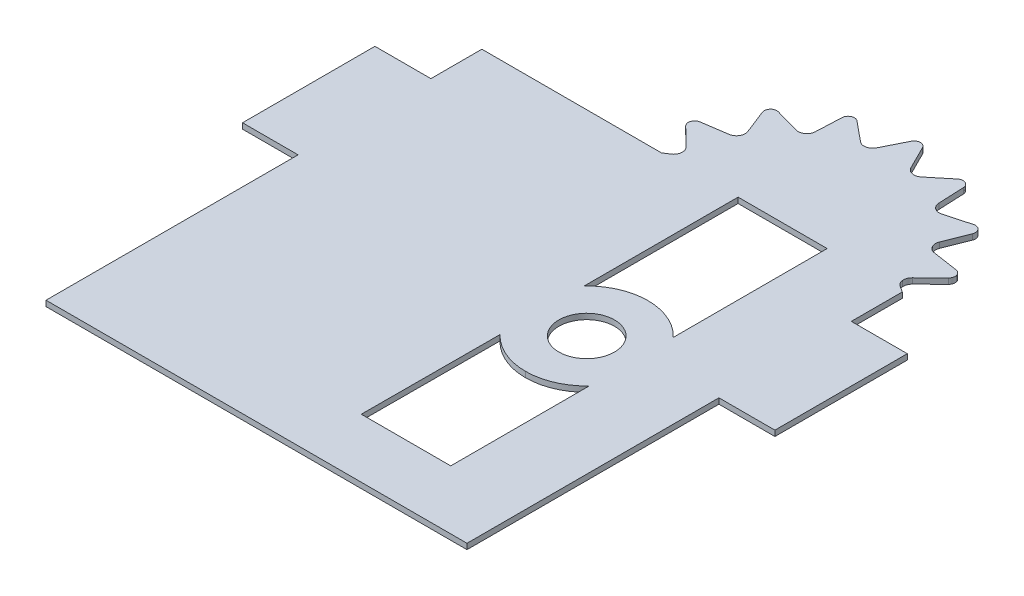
ISO-10303-21;
HEADER;
FILE_DESCRIPTION(('STEP AP214'),'2;1');
FILE_NAME('part.step','',(''),(''),'','','');
FILE_SCHEMA(('AUTOMOTIVE_DESIGN { 1 0 10303 214 1 1 1 1 }'));
ENDSEC;
DATA;
#1=APPLICATION_CONTEXT('core data for automotive mechanical design processes');
#2=APPLICATION_PROTOCOL_DEFINITION('international standard','automotive_design',2000,#1);
#3=PRODUCT_CONTEXT('',#1,'mechanical');
#4=PRODUCT('Part','Part','',(#3));
#5=PRODUCT_RELATED_PRODUCT_CATEGORY('part','',(#4));
#6=PRODUCT_DEFINITION_FORMATION('','',#4);
#7=PRODUCT_DEFINITION_CONTEXT('part definition',#1,'design');
#8=PRODUCT_DEFINITION('design','',#6,#7);
#9=PRODUCT_DEFINITION_SHAPE('','',#8);
#10=(LENGTH_UNIT() NAMED_UNIT(*) SI_UNIT(.MILLI.,.METRE.));
#11=(NAMED_UNIT(*) PLANE_ANGLE_UNIT() SI_UNIT($,.RADIAN.));
#12=(NAMED_UNIT(*) SI_UNIT($,.STERADIAN.) SOLID_ANGLE_UNIT());
#13=UNCERTAINTY_MEASURE_WITH_UNIT(LENGTH_MEASURE(1.E-05),#10,'distance_accuracy_value','');
#14=(GEOMETRIC_REPRESENTATION_CONTEXT(3) GLOBAL_UNCERTAINTY_ASSIGNED_CONTEXT((#13)) GLOBAL_UNIT_ASSIGNED_CONTEXT((#10,
#11,#12)) REPRESENTATION_CONTEXT('',''));
#15=CARTESIAN_POINT('',(0.,0.,0.));
#16=DIRECTION('',(0.,0.,1.));
#17=DIRECTION('',(1.,0.,0.));
#18=AXIS2_PLACEMENT_3D('',#15,#16,#17);
#19=CARTESIAN_POINT('',(-5.1612,2.,-36.073725));
#20=DIRECTION('',(0.,-1.,0.));
#21=DIRECTION('',(0.,0.,-1.));
#22=AXIS2_PLACEMENT_3D('',#19,#20,#21);
#23=PLANE('',#22);
#24=CARTESIAN_POINT('',(15.063,2.,-10.7142));
#25=CARTESIAN_POINT('',(18.215,2.,-10.7142));
#26=CARTESIAN_POINT('',(21.057,2.,-9.3881));
#27=CARTESIAN_POINT('',(23.0626,2.,-7.2637));
#28=B_SPLINE_CURVE_WITH_KNOTS('',3,(#24,#25,#26,#27),.UNSPECIFIED.,.F.,.F.,(4,4),(0.6,0.8),.UNSPECIFIED.);
#29=CARTESIAN_POINT('',(15.063,2.,-10.7142));
#30=VERTEX_POINT('',#29);
#31=CARTESIAN_POINT('',(23.0626,2.,-7.2637));
#32=VERTEX_POINT('',#31);
#33=EDGE_CURVE('E2126',#30,#32,#28,.T.);
#34=ORIENTED_EDGE('',*,*,#33,.F.);
#35=CARTESIAN_POINT('',(7.0634,2.,-7.2637));
#36=CARTESIAN_POINT('',(9.069,2.,-9.3881));
#37=CARTESIAN_POINT('',(11.911,2.,-10.7142));
#38=CARTESIAN_POINT('',(15.063,2.,-10.7142));
#39=B_SPLINE_CURVE_WITH_KNOTS('',3,(#35,#36,#37,#38),.UNSPECIFIED.,.F.,.F.,(4,4),(0.4,0.6),.UNSPECIFIED.);
#40=CARTESIAN_POINT('',(7.0634,2.,-7.2637));
#41=VERTEX_POINT('',#40);
#42=EDGE_CURVE('E50',#41,#30,#39,.T.);
#43=ORIENTED_EDGE('',*,*,#42,.F.);
#44=DIRECTION('',(0.,0.,1.));
#45=VECTOR('',#44,1.);
#46=CARTESIAN_POINT('',(7.0634,2.,-34.9083));
#47=LINE('',#46,#45);
#48=CARTESIAN_POINT('',(7.0634,2.,-34.9083));
#49=VERTEX_POINT('',#48);
#50=EDGE_CURVE('E2127',#49,#41,#47,.T.);
#51=ORIENTED_EDGE('',*,*,#50,.F.);
#52=DIRECTION('',(-1.,0.,0.));
#53=VECTOR('',#52,1.);
#54=CARTESIAN_POINT('',(23.0626,2.,-34.9083));
#55=LINE('',#54,#53);
#56=CARTESIAN_POINT('',(23.0626,2.,-34.9083));
#57=VERTEX_POINT('',#56);
#58=EDGE_CURVE('E2179',#57,#49,#55,.T.);
#59=ORIENTED_EDGE('',*,*,#58,.F.);
#60=DIRECTION('',(0.,0.,-1.));
#61=VECTOR('',#60,1.);
#62=CARTESIAN_POINT('',(23.0626,2.,-7.2637));
#63=LINE('',#62,#61);
#64=EDGE_CURVE('E2161',#32,#57,#63,.T.);
#65=ORIENTED_EDGE('',*,*,#64,.F.);
#66=EDGE_LOOP('',(#34,#43,#51,#59,#65));
#67=FACE_BOUND('',#66,.T.);
#68=DIRECTION('',(1.,0.,0.));
#69=VECTOR('',#68,1.);
#70=CARTESIAN_POINT('',(6.9935,2.,32.7046));
#71=LINE('',#70,#69);
#72=CARTESIAN_POINT('',(6.9935,2.,32.7046));
#73=VERTEX_POINT('',#72);
#74=CARTESIAN_POINT('',(23.0626,2.,32.7046));
#75=VERTEX_POINT('',#74);
#76=EDGE_CURVE('E2080',#73,#75,#71,.T.);
#77=ORIENTED_EDGE('',*,*,#76,.F.);
#78=DIRECTION('',(-0.00281068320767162,0.,0.999996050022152));
#79=VECTOR('',#78,1.);
#80=CARTESIAN_POINT('',(7.0634,2.,7.8353));
#81=LINE('',#80,#79);
#82=CARTESIAN_POINT('',(7.0634,2.,7.8353));
#83=VERTEX_POINT('',#82);
#84=EDGE_CURVE('E2073',#83,#73,#81,.T.);
#85=ORIENTED_EDGE('',*,*,#84,.F.);
#86=CARTESIAN_POINT('',(15.063,2.,11.2858));
#87=CARTESIAN_POINT('',(11.911,2.,11.2858));
#88=CARTESIAN_POINT('',(9.069,2.,9.9597));
#89=CARTESIAN_POINT('',(7.0634,2.,7.8353));
#90=B_SPLINE_CURVE_WITH_KNOTS('',3,(#86,#87,#88,#89),.UNSPECIFIED.,.F.,.F.,(4,4),(0.4,0.6),.UNSPECIFIED.);
#91=CARTESIAN_POINT('',(15.063,2.,11.2858));
#92=VERTEX_POINT('',#91);
#93=EDGE_CURVE('E2106',#92,#83,#90,.T.);
#94=ORIENTED_EDGE('',*,*,#93,.F.);
#95=CARTESIAN_POINT('',(23.0626,2.,7.8353));
#96=CARTESIAN_POINT('',(21.057,2.,9.9597));
#97=CARTESIAN_POINT('',(18.215,2.,11.2858));
#98=CARTESIAN_POINT('',(15.063,2.,11.2858));
#99=B_SPLINE_CURVE_WITH_KNOTS('',3,(#95,#96,#97,#98),.UNSPECIFIED.,.F.,.F.,(4,4),(0.2,0.4),.UNSPECIFIED.);
#100=CARTESIAN_POINT('',(23.0626,2.,7.8353));
#101=VERTEX_POINT('',#100);
#102=EDGE_CURVE('E2112',#101,#92,#99,.T.);
#103=ORIENTED_EDGE('',*,*,#102,.F.);
#104=DIRECTION('',(0.,0.,-1.));
#105=VECTOR('',#104,1.);
#106=CARTESIAN_POINT('',(23.0626,2.,32.7046));
#107=LINE('',#106,#105);
#108=EDGE_CURVE('E2082',#75,#101,#107,.T.);
#109=ORIENTED_EDGE('',*,*,#108,.F.);
#110=EDGE_LOOP('',(#77,#85,#94,#103,#109));
#111=FACE_BOUND('',#110,.T.);
#112=DIRECTION('',(-0.00058557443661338,0.,0.999999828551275));
#113=VECTOR('',#112,1.);
#114=CARTESIAN_POINT('',(-39.0591,2.,43.2851));
#115=LINE('',#114,#113);
#116=CARTESIAN_POINT('',(-39.0326,2.,-1.9696));
#117=VERTEX_POINT('',#116);
#118=CARTESIAN_POINT('',(-39.0590998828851,2.,43.2847));
#119=VERTEX_POINT('',#118);
#120=EDGE_CURVE('E474',#117,#119,#115,.T.);
#121=ORIENTED_EDGE('',*,*,#120,.T.);
#122=DIRECTION('',(-1.,0.,0.));
#123=VECTOR('',#122,1.);
#124=CARTESIAN_POINT('',(36.5597,2.,43.2847));
#125=LINE('',#124,#123);
#126=CARTESIAN_POINT('',(36.5597,2.,43.2847));
#127=VERTEX_POINT('',#126);
#128=EDGE_CURVE('E465',#127,#119,#125,.T.);
#129=ORIENTED_EDGE('',*,*,#128,.F.);
#130=DIRECTION('',(0.,0.,-1.));
#131=VECTOR('',#130,1.);
#132=CARTESIAN_POINT('',(36.5597,2.,-1.9696));
#133=LINE('',#132,#131);
#134=CARTESIAN_POINT('',(36.5597,2.,-1.9696));
#135=VERTEX_POINT('',#134);
#136=EDGE_CURVE('E480',#127,#135,#133,.T.);
#137=ORIENTED_EDGE('',*,*,#136,.T.);
#138=DIRECTION('',(1.,0.,0.));
#139=VECTOR('',#138,1.);
#140=CARTESIAN_POINT('',(46.6141,2.,-1.9696));
#141=LINE('',#140,#139);
#142=CARTESIAN_POINT('',(46.6141,2.,-1.9696));
#143=VERTEX_POINT('',#142);
#144=EDGE_CURVE('E485',#135,#143,#141,.T.);
#145=ORIENTED_EDGE('',*,*,#144,.T.);
#146=DIRECTION('',(0.,0.,-1.));
#147=VECTOR('',#146,1.);
#148=CARTESIAN_POINT('',(46.6141,2.,-25.7503));
#149=LINE('',#148,#147);
#150=CARTESIAN_POINT('',(46.6141,2.,-25.7503));
#151=VERTEX_POINT('',#150);
#152=EDGE_CURVE('E488',#143,#151,#149,.T.);
#153=ORIENTED_EDGE('',*,*,#152,.T.);
#154=DIRECTION('',(-1.,0.,0.));
#155=VECTOR('',#154,1.);
#156=CARTESIAN_POINT('',(36.5597,2.,-25.7503));
#157=LINE('',#156,#155);
#158=CARTESIAN_POINT('',(36.5597,2.,-25.7503));
#159=VERTEX_POINT('',#158);
#160=EDGE_CURVE('E498',#151,#159,#157,.T.);
#161=ORIENTED_EDGE('',*,*,#160,.T.);
#162=DIRECTION('',(0.,0.,-1.));
#163=VECTOR('',#162,1.);
#164=CARTESIAN_POINT('',(36.5597,2.,-34.9083));
#165=LINE('',#164,#163);
#166=CARTESIAN_POINT('',(36.5597,2.,-34.9083));
#167=VERTEX_POINT('',#166);
#168=EDGE_CURVE('E500',#159,#167,#165,.T.);
#169=ORIENTED_EDGE('',*,*,#168,.T.);
#170=DIRECTION('',(-0.842790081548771,0.,-0.53824239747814));
#171=VECTOR('',#170,1.);
#172=CARTESIAN_POINT('',(35.507,2.,-35.5806));
#173=LINE('',#172,#171);
#174=CARTESIAN_POINT('',(35.507,2.,-35.5806));
#175=VERTEX_POINT('',#174);
#176=EDGE_CURVE('E502',#167,#175,#173,.T.);
#177=ORIENTED_EDGE('',*,*,#176,.T.);
#178=CARTESIAN_POINT('',(35.507,2.,-35.5806));
#179=CARTESIAN_POINT('',(35.0921,2.,-35.8456));
#180=CARTESIAN_POINT('',(34.845,2.,-36.2454));
#181=CARTESIAN_POINT('',(34.7936,2.,-36.7349));
#182=B_SPLINE_CURVE_WITH_KNOTS('',3,(#178,#179,#180,#181),.UNSPECIFIED.,.F.,.F.,(4,4),
(0.879310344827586,0.896551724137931),.UNSPECIFIED.);
#183=CARTESIAN_POINT('',(34.7936,2.,-36.7349));
#184=VERTEX_POINT('',#183);
#185=EDGE_CURVE('E504',#175,#184,#182,.T.);
#186=ORIENTED_EDGE('',*,*,#185,.T.);
#187=CARTESIAN_POINT('',(34.7936,2.,-36.7349));
#188=CARTESIAN_POINT('',(34.7421,2.,-37.2244));
#189=CARTESIAN_POINT('',(34.9008,2.,-37.6669));
#190=CARTESIAN_POINT('',(35.2514,2.,-38.0123));
#191=B_SPLINE_CURVE_WITH_KNOTS('',3,(#187,#188,#189,#190),.UNSPECIFIED.,.F.,.F.,(4,4),
(0.862068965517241,0.879310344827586),.UNSPECIFIED.);
#192=CARTESIAN_POINT('',(35.2514,2.,-38.0123));
#193=VERTEX_POINT('',#192);
#194=EDGE_CURVE('E509',#184,#193,#191,.T.);
#195=ORIENTED_EDGE('',*,*,#194,.T.);
#196=DIRECTION('',(0.712439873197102,0.,-0.701733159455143));
#197=VECTOR('',#196,1.);
#198=CARTESIAN_POINT('',(38.5452,2.,-41.2566));
#199=LINE('',#198,#197);
#200=CARTESIAN_POINT('',(38.5452,2.,-41.2566));
#201=VERTEX_POINT('',#200);
#202=EDGE_CURVE('E1329',#193,#201,#199,.T.);
#203=ORIENTED_EDGE('',*,*,#202,.T.);
#204=CARTESIAN_POINT('',(38.5452,2.,-41.2566));
#205=CARTESIAN_POINT('',(38.8583,2.,-41.5649));
#206=CARTESIAN_POINT('',(38.9631,2.,-41.9948));
#207=CARTESIAN_POINT('',(38.8273,2.,-42.4129));
#208=B_SPLINE_CURVE_WITH_KNOTS('',3,(#204,#205,#206,#207),.UNSPECIFIED.,.F.,.F.,(4,4),
(0.827586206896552,0.844827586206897),.UNSPECIFIED.);
#209=CARTESIAN_POINT('',(38.8273,2.,-42.4129));
#210=VERTEX_POINT('',#209);
#211=EDGE_CURVE('E1325',#201,#210,#208,.T.);
#212=ORIENTED_EDGE('',*,*,#211,.T.);
#213=CARTESIAN_POINT('',(38.8273,2.,-42.4129));
#214=CARTESIAN_POINT('',(38.6917,2.,-42.8307));
#215=CARTESIAN_POINT('',(38.354,2.,-43.1169));
#216=CARTESIAN_POINT('',(37.9194,2.,-43.1823));
#217=B_SPLINE_CURVE_WITH_KNOTS('',3,(#213,#214,#215,#216),.UNSPECIFIED.,.F.,.F.,(4,4),
(0.810344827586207,0.827586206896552),.UNSPECIFIED.);
#218=CARTESIAN_POINT('',(37.9194,2.,-43.1823));
#219=VERTEX_POINT('',#218);
#220=EDGE_CURVE('E1316',#210,#219,#217,.T.);
#221=ORIENTED_EDGE('',*,*,#220,.T.);
#222=DIRECTION('',(-0.98884812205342,0.,-0.148927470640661));
#223=VECTOR('',#222,1.);
#224=CARTESIAN_POINT('',(33.3479,2.,-43.8708));
#225=LINE('',#224,#223);
#226=CARTESIAN_POINT('',(33.3479,2.,-43.8708));
#227=VERTEX_POINT('',#226);
#228=EDGE_CURVE('E1311',#219,#227,#225,.T.);
#229=ORIENTED_EDGE('',*,*,#228,.T.);
#230=CARTESIAN_POINT('',(33.3479,2.,-43.8708));
#231=CARTESIAN_POINT('',(32.8613,2.,-43.944));
#232=CARTESIAN_POINT('',(32.4728,2.,-44.2089));
#233=CARTESIAN_POINT('',(32.2267,2.,-44.6351));
#234=B_SPLINE_CURVE_WITH_KNOTS('',3,(#230,#231,#232,#233),.UNSPECIFIED.,.F.,.F.,(4,4),
(0.775862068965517,0.793103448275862),.UNSPECIFIED.);
#235=CARTESIAN_POINT('',(32.2267,2.,-44.6351));
#236=VERTEX_POINT('',#235);
#237=EDGE_CURVE('E1307',#227,#236,#234,.T.);
#238=ORIENTED_EDGE('',*,*,#237,.T.);
#239=CARTESIAN_POINT('',(32.2267,2.,-44.6351));
#240=CARTESIAN_POINT('',(31.9806,2.,-45.0613));
#241=CARTESIAN_POINT('',(31.9454,2.,-45.5301));
#242=CARTESIAN_POINT('',(32.1253,2.,-45.9883));
#243=B_SPLINE_CURVE_WITH_KNOTS('',3,(#239,#240,#241,#242),.UNSPECIFIED.,.F.,.F.,(4,4),
(0.758620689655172,0.775862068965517),.UNSPECIFIED.);
#244=CARTESIAN_POINT('',(32.1253,2.,-45.9883));
#245=VERTEX_POINT('',#244);
#246=EDGE_CURVE('E1298',#236,#245,#243,.T.);
#247=ORIENTED_EDGE('',*,*,#246,.T.);
#248=DIRECTION('',(0.365453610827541,0.,-0.930829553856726));
#249=VECTOR('',#248,1.);
#250=CARTESIAN_POINT('',(33.8149,2.,-50.2918));
#251=LINE('',#250,#249);
#252=CARTESIAN_POINT('',(33.8149,2.,-50.2918));
#253=VERTEX_POINT('',#252);
#254=EDGE_CURVE('E1293',#245,#253,#251,.T.);
#255=ORIENTED_EDGE('',*,*,#254,.T.);
#256=CARTESIAN_POINT('',(33.8149,2.,-50.2918));
#257=CARTESIAN_POINT('',(33.9755,2.,-50.7008));
#258=CARTESIAN_POINT('',(33.8963,2.,-51.1362));
#259=CARTESIAN_POINT('',(33.6022,2.,-51.4629));
#260=B_SPLINE_CURVE_WITH_KNOTS('',3,(#256,#257,#258,#259),.UNSPECIFIED.,.F.,.F.,(4,4),
(0.724137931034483,0.741379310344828),.UNSPECIFIED.);
#261=CARTESIAN_POINT('',(33.6022,2.,-51.4629));
#262=VERTEX_POINT('',#261);
#263=EDGE_CURVE('E1289',#253,#262,#260,.T.);
#264=ORIENTED_EDGE('',*,*,#263,.T.);
#265=CARTESIAN_POINT('',(33.6022,2.,-51.4629));
#266=CARTESIAN_POINT('',(33.3084,2.,-51.7893));
#267=CARTESIAN_POINT('',(32.8835,2.,-51.9135));
#268=CARTESIAN_POINT('',(32.4599,2.,-51.7965));
#269=B_SPLINE_CURVE_WITH_KNOTS('',3,(#265,#266,#267,#268),.UNSPECIFIED.,.F.,.F.,(4,4),
(0.706896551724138,0.724137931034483),.UNSPECIFIED.);
#270=CARTESIAN_POINT('',(32.4599,2.,-51.7965));
#271=VERTEX_POINT('',#270);
#272=EDGE_CURVE('E1280',#262,#271,#269,.T.);
#273=ORIENTED_EDGE('',*,*,#272,.T.);
#274=DIRECTION('',(-0.96393446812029,0.,0.266139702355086));
#275=VECTOR('',#274,1.);
#276=CARTESIAN_POINT('',(28.0035,2.,-50.5661));
#277=LINE('',#276,#275);
#278=CARTESIAN_POINT('',(28.0035,2.,-50.5661));
#279=VERTEX_POINT('',#278);
#280=EDGE_CURVE('E1275',#271,#279,#277,.T.);
#281=ORIENTED_EDGE('',*,*,#280,.T.);
#282=CARTESIAN_POINT('',(28.0035,2.,-50.5661));
#283=CARTESIAN_POINT('',(27.529,2.,-50.4351));
#284=CARTESIAN_POINT('',(27.0665,2.,-50.519));
#285=CARTESIAN_POINT('',(26.6683,2.,-50.8083));
#286=B_SPLINE_CURVE_WITH_KNOTS('',3,(#282,#283,#284,#285),.UNSPECIFIED.,.F.,.F.,(4,4),
(0.672413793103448,0.689655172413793),.UNSPECIFIED.);
#287=CARTESIAN_POINT('',(26.6683,2.,-50.8083));
#288=VERTEX_POINT('',#287);
#289=EDGE_CURVE('E1271',#279,#288,#286,.T.);
#290=ORIENTED_EDGE('',*,*,#289,.T.);
#291=CARTESIAN_POINT('',(26.6683,2.,-50.8083));
#292=CARTESIAN_POINT('',(26.2702,2.,-51.0976));
#293=CARTESIAN_POINT('',(26.0474,2.,-51.5116));
#294=CARTESIAN_POINT('',(26.0254,2.,-52.0032));
#295=B_SPLINE_CURVE_WITH_KNOTS('',3,(#291,#292,#293,#294),.UNSPECIFIED.,.F.,.F.,(4,4),
(0.655172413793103,0.672413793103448),.UNSPECIFIED.);
#296=CARTESIAN_POINT('',(26.0254,2.,-52.0032));
#297=VERTEX_POINT('',#296);
#298=EDGE_CURVE('E1262',#288,#297,#295,.T.);
#299=ORIENTED_EDGE('',*,*,#298,.T.);
#300=DIRECTION('',(-0.0447522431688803,0.,-0.998998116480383));
#301=VECTOR('',#300,1.);
#302=CARTESIAN_POINT('',(25.8185,2.,-56.6218));
#303=LINE('',#302,#301);
#304=CARTESIAN_POINT('',(25.8185,2.,-56.6218));
#305=VERTEX_POINT('',#304);
#306=EDGE_CURVE('E1257',#297,#305,#303,.T.);
#307=ORIENTED_EDGE('',*,*,#306,.T.);
#308=CARTESIAN_POINT('',(25.8185,2.,-56.6218));
#309=CARTESIAN_POINT('',(25.7988,2.,-57.0608));
#310=CARTESIAN_POINT('',(25.5495,2.,-57.4264));
#311=CARTESIAN_POINT('',(25.1479,2.,-57.6052));
#312=B_SPLINE_CURVE_WITH_KNOTS('',3,(#308,#309,#310,#311),.UNSPECIFIED.,.F.,.F.,(4,4),
(0.620689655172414,0.637931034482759),.UNSPECIFIED.);
#313=CARTESIAN_POINT('',(25.1479,2.,-57.6052));
#314=VERTEX_POINT('',#313);
#315=EDGE_CURVE('E1253',#305,#314,#312,.T.);
#316=ORIENTED_EDGE('',*,*,#315,.T.);
#317=CARTESIAN_POINT('',(25.1479,2.,-57.6052));
#318=CARTESIAN_POINT('',(24.7467,2.,-57.7839));
#319=CARTESIAN_POINT('',(24.3081,2.,-57.7245));
#320=CARTESIAN_POINT('',(23.9687,2.,-57.4454));
#321=B_SPLINE_CURVE_WITH_KNOTS('',3,(#317,#318,#319,#320),.UNSPECIFIED.,.F.,.F.,(4,4),
(0.603448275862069,0.620689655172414),.UNSPECIFIED.);
#322=CARTESIAN_POINT('',(23.9687,2.,-57.4454));
#323=VERTEX_POINT('',#322);
#324=EDGE_CURVE('E1244',#314,#323,#321,.T.);
#325=ORIENTED_EDGE('',*,*,#324,.T.);
#326=DIRECTION('',(-0.772341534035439,0.,0.635207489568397));
#327=VECTOR('',#326,1.);
#328=CARTESIAN_POINT('',(20.398,2.,-54.5087));
#329=LINE('',#328,#327);
#330=CARTESIAN_POINT('',(20.398,2.,-54.5087));
#331=VERTEX_POINT('',#330);
#332=EDGE_CURVE('E1239',#323,#331,#329,.T.);
#333=ORIENTED_EDGE('',*,*,#332,.T.);
#334=CARTESIAN_POINT('',(20.398,2.,-54.5087));
#335=CARTESIAN_POINT('',(20.0179,2.,-54.1961));
#336=CARTESIAN_POINT('',(19.5612,2.,-54.0846));
#337=CARTESIAN_POINT('',(19.0798,2.,-54.1869));
#338=B_SPLINE_CURVE_WITH_KNOTS('',3,(#334,#335,#336,#337),.UNSPECIFIED.,.F.,.F.,(4,4),
(0.568965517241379,0.586206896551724),.UNSPECIFIED.);
#339=CARTESIAN_POINT('',(19.0798,2.,-54.1869));
#340=VERTEX_POINT('',#339);
#341=EDGE_CURVE('E1235',#331,#340,#338,.T.);
#342=ORIENTED_EDGE('',*,*,#341,.T.);
#343=CARTESIAN_POINT('',(19.0798,2.,-54.1869));
#344=CARTESIAN_POINT('',(18.5984,2.,-54.2893));
#345=CARTESIAN_POINT('',(18.2265,2.,-54.5769));
#346=CARTESIAN_POINT('',(18.0064,2.,-55.0171));
#347=B_SPLINE_CURVE_WITH_KNOTS('',3,(#343,#344,#345,#346),.UNSPECIFIED.,.F.,.F.,(4,4),
(0.551724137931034,0.568965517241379),.UNSPECIFIED.);
#348=CARTESIAN_POINT('',(18.0064,2.,-55.0171));
#349=VERTEX_POINT('',#348);
#350=EDGE_CURVE('E1226',#340,#349,#347,.T.);
#351=ORIENTED_EDGE('',*,*,#350,.T.);
#352=DIRECTION('',(-0.447222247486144,0.,-0.894422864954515));
#353=VECTOR('',#352,1.);
#354=CARTESIAN_POINT('',(15.9388,2.,-59.1522));
#355=LINE('',#354,#353);
#356=CARTESIAN_POINT('',(15.9388,2.,-59.1522));
#357=VERTEX_POINT('',#356);
#358=EDGE_CURVE('E1221',#349,#357,#355,.T.);
#359=ORIENTED_EDGE('',*,*,#358,.T.);
#360=CARTESIAN_POINT('',(15.9388,2.,-59.1522));
#361=CARTESIAN_POINT('',(15.7424,2.,-59.5452));
#362=CARTESIAN_POINT('',(15.3659,2.,-59.7779));
#363=CARTESIAN_POINT('',(14.9264,2.,-59.7779));
#364=B_SPLINE_CURVE_WITH_KNOTS('',3,(#360,#361,#362,#363),.UNSPECIFIED.,.F.,.F.,(4,4),
(0.517241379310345,0.53448275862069),.UNSPECIFIED.);
#365=CARTESIAN_POINT('',(14.9264,2.,-59.7779));
#366=VERTEX_POINT('',#365);
#367=EDGE_CURVE('E1217',#357,#366,#364,.T.);
#368=ORIENTED_EDGE('',*,*,#367,.T.);
#369=CARTESIAN_POINT('',(14.9264,2.,-59.7779));
#370=CARTESIAN_POINT('',(14.4869,2.,-59.7779));
#371=CARTESIAN_POINT('',(14.1104,2.,-59.5451));
#372=CARTESIAN_POINT('',(13.9139,2.,-59.152));
#373=B_SPLINE_CURVE_WITH_KNOTS('',3,(#369,#370,#371,#372),.UNSPECIFIED.,.F.,.F.,(4,4),(0.5,
0.517241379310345),.UNSPECIFIED.);
#374=CARTESIAN_POINT('',(13.9139,2.,-59.152));
#375=VERTEX_POINT('',#374);
#376=EDGE_CURVE('E1208',#366,#375,#373,.T.);
#377=ORIENTED_EDGE('',*,*,#376,.T.);
#378=DIRECTION('',(-0.447204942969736,0.,0.894431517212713));
#379=VECTOR('',#378,1.);
#380=CARTESIAN_POINT('',(11.8465,2.,-55.0171));
#381=LINE('',#380,#379);
#382=CARTESIAN_POINT('',(11.8465,2.,-55.0171));
#383=VERTEX_POINT('',#382);
#384=EDGE_CURVE('E1203',#375,#383,#381,.T.);
#385=ORIENTED_EDGE('',*,*,#384,.T.);
#386=CARTESIAN_POINT('',(11.8465,2.,-55.0171));
#387=CARTESIAN_POINT('',(11.6264,2.,-54.5769));
#388=CARTESIAN_POINT('',(11.2545,2.,-54.2893));
#389=CARTESIAN_POINT('',(10.7731,2.,-54.1869));
#390=B_SPLINE_CURVE_WITH_KNOTS('',3,(#386,#387,#388,#389),.UNSPECIFIED.,.F.,.F.,(4,4),
(0.46551724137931,0.482758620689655),.UNSPECIFIED.);
#391=CARTESIAN_POINT('',(10.7731,2.,-54.1869));
#392=VERTEX_POINT('',#391);
#393=EDGE_CURVE('E1199',#383,#392,#390,.T.);
#394=ORIENTED_EDGE('',*,*,#393,.T.);
#395=CARTESIAN_POINT('',(10.7731,2.,-54.1869));
#396=CARTESIAN_POINT('',(10.2917,2.,-54.0846));
#397=CARTESIAN_POINT('',(9.835,2.,-54.1961));
#398=CARTESIAN_POINT('',(9.4549,2.,-54.5087));
#399=B_SPLINE_CURVE_WITH_KNOTS('',3,(#395,#396,#397,#398),.UNSPECIFIED.,.F.,.F.,(4,4),
(0.448275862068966,0.46551724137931),.UNSPECIFIED.);
#400=CARTESIAN_POINT('',(9.4549,2.,-54.5087));
#401=VERTEX_POINT('',#400);
#402=EDGE_CURVE('E1190',#392,#401,#399,.T.);
#403=ORIENTED_EDGE('',*,*,#402,.T.);
#404=DIRECTION('',(-0.772350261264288,0.,-0.635196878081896));
#405=VECTOR('',#404,1.);
#406=CARTESIAN_POINT('',(5.8841,2.,-57.4454));
#407=LINE('',#406,#405);
#408=CARTESIAN_POINT('',(5.8841,2.,-57.4454));
#409=VERTEX_POINT('',#408);
#410=EDGE_CURVE('E1185',#401,#409,#407,.T.);
#411=ORIENTED_EDGE('',*,*,#410,.T.);
#412=CARTESIAN_POINT('',(5.8841,2.,-57.4454));
#413=CARTESIAN_POINT('',(5.5448,2.,-57.7245));
#414=CARTESIAN_POINT('',(5.1062,2.,-57.7839));
#415=CARTESIAN_POINT('',(4.7048,2.,-57.6052));
#416=B_SPLINE_CURVE_WITH_KNOTS('',3,(#412,#413,#414,#415),.UNSPECIFIED.,.F.,.F.,(4,4),
(0.413793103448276,0.431034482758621),.UNSPECIFIED.);
#417=CARTESIAN_POINT('',(4.7048,2.,-57.6052));
#418=VERTEX_POINT('',#417);
#419=EDGE_CURVE('E1181',#409,#418,#416,.T.);
#420=ORIENTED_EDGE('',*,*,#419,.T.);
#421=CARTESIAN_POINT('',(4.7048,2.,-57.6052));
#422=CARTESIAN_POINT('',(4.3032,2.,-57.4264));
#423=CARTESIAN_POINT('',(4.0539,2.,-57.0606));
#424=CARTESIAN_POINT('',(4.0343,2.,-56.6217));
#425=B_SPLINE_CURVE_WITH_KNOTS('',3,(#421,#422,#423,#424),.UNSPECIFIED.,.F.,.F.,(4,4),
(0.396551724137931,0.413793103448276),.UNSPECIFIED.);
#426=CARTESIAN_POINT('',(4.0343,2.,-56.6217));
#427=VERTEX_POINT('',#426);
#428=EDGE_CURVE('E1172',#418,#427,#425,.T.);
#429=ORIENTED_EDGE('',*,*,#428,.T.);
#430=DIRECTION('',(-0.0447316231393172,0.,0.998999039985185));
#431=VECTOR('',#430,1.);
#432=CARTESIAN_POINT('',(3.8275,2.,-52.0032));
#433=LINE('',#432,#431);
#434=CARTESIAN_POINT('',(3.8275,2.,-52.0032));
#435=VERTEX_POINT('',#434);
#436=EDGE_CURVE('E1167',#427,#435,#433,.T.);
#437=ORIENTED_EDGE('',*,*,#436,.T.);
#438=CARTESIAN_POINT('',(3.8275,2.,-52.0032));
#439=CARTESIAN_POINT('',(3.8054,2.,-51.5116));
#440=CARTESIAN_POINT('',(3.5826,2.,-51.0976));
#441=CARTESIAN_POINT('',(3.1845,2.,-50.8083));
#442=B_SPLINE_CURVE_WITH_KNOTS('',3,(#438,#439,#440,#441),.UNSPECIFIED.,.F.,.F.,(4,4),
(0.362068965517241,0.379310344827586),.UNSPECIFIED.);
#443=CARTESIAN_POINT('',(3.1845,2.,-50.8083));
#444=VERTEX_POINT('',#443);
#445=EDGE_CURVE('E1163',#435,#444,#442,.T.);
#446=ORIENTED_EDGE('',*,*,#445,.T.);
#447=CARTESIAN_POINT('',(3.1845,2.,-50.8083));
#448=CARTESIAN_POINT('',(2.7864,2.,-50.519));
#449=CARTESIAN_POINT('',(2.3237,2.,-50.4351));
#450=CARTESIAN_POINT('',(1.8493,2.,-50.5661));
#451=B_SPLINE_CURVE_WITH_KNOTS('',3,(#447,#448,#449,#450),.UNSPECIFIED.,.F.,.F.,(4,4),
(0.344827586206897,0.362068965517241),.UNSPECIFIED.);
#452=CARTESIAN_POINT('',(1.8493,2.,-50.5661));
#453=VERTEX_POINT('',#452);
#454=EDGE_CURVE('E1154',#444,#453,#451,.T.);
#455=ORIENTED_EDGE('',*,*,#454,.T.);
#456=DIRECTION('',(-0.963941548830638,0.,-0.266114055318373));
#457=VECTOR('',#456,1.);
#458=CARTESIAN_POINT('',(-2.6072,2.,-51.7964));
#459=LINE('',#458,#457);
#460=CARTESIAN_POINT('',(-2.6072,2.,-51.7964));
#461=VERTEX_POINT('',#460);
#462=EDGE_CURVE('E1149',#453,#461,#459,.T.);
#463=ORIENTED_EDGE('',*,*,#462,.T.);
#464=CARTESIAN_POINT('',(-2.6072,2.,-51.7964));
#465=CARTESIAN_POINT('',(-3.0306,2.,-51.9135));
#466=CARTESIAN_POINT('',(-3.4555,2.,-51.7893));
#467=CARTESIAN_POINT('',(-3.7495,2.,-51.4628));
#468=B_SPLINE_CURVE_WITH_KNOTS('',3,(#464,#465,#466,#467),.UNSPECIFIED.,.F.,.F.,(4,4),
(0.310344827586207,0.327586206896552),.UNSPECIFIED.);
#469=CARTESIAN_POINT('',(-3.7495,2.,-51.4628));
#470=VERTEX_POINT('',#469);
#471=EDGE_CURVE('E1145',#461,#470,#468,.T.);
#472=ORIENTED_EDGE('',*,*,#471,.T.);
#473=CARTESIAN_POINT('',(-3.7495,2.,-51.4628));
#474=CARTESIAN_POINT('',(-4.0436,2.,-51.1362));
#475=CARTESIAN_POINT('',(-4.1226,2.,-50.7006));
#476=CARTESIAN_POINT('',(-3.962,2.,-50.2917));
#477=B_SPLINE_CURVE_WITH_KNOTS('',3,(#473,#474,#475,#476),.UNSPECIFIED.,.F.,.F.,(4,4),
(0.293103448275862,0.310344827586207),.UNSPECIFIED.);
#478=CARTESIAN_POINT('',(-3.962,2.,-50.2917));
#479=VERTEX_POINT('',#478);
#480=EDGE_CURVE('E1136',#470,#479,#477,.T.);
#481=ORIENTED_EDGE('',*,*,#480,.T.);
#482=DIRECTION('',(0.365442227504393,0.,0.930834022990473));
#483=VECTOR('',#482,1.);
#484=CARTESIAN_POINT('',(-2.2725,2.,-45.9883));
#485=LINE('',#484,#483);
#486=CARTESIAN_POINT('',(-2.2725,2.,-45.9883));
#487=VERTEX_POINT('',#486);
#488=EDGE_CURVE('E1131',#479,#487,#485,.T.);
#489=ORIENTED_EDGE('',*,*,#488,.T.);
#490=CARTESIAN_POINT('',(-2.2725,2.,-45.9883));
#491=CARTESIAN_POINT('',(-2.0926,2.,-45.5302));
#492=CARTESIAN_POINT('',(-2.1277,2.,-45.0614));
#493=CARTESIAN_POINT('',(-2.3738,2.,-44.6352));
#494=B_SPLINE_CURVE_WITH_KNOTS('',3,(#490,#491,#492,#493),.UNSPECIFIED.,.F.,.F.,(4,4),
(0.258620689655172,0.275862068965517),.UNSPECIFIED.);
#495=CARTESIAN_POINT('',(-2.3738,2.,-44.6352));
#496=VERTEX_POINT('',#495);
#497=EDGE_CURVE('E1127',#487,#496,#494,.T.);
#498=ORIENTED_EDGE('',*,*,#497,.T.);
#499=CARTESIAN_POINT('',(-2.3738,2.,-44.6352));
#500=CARTESIAN_POINT('',(-2.6199,2.,-44.209));
#501=CARTESIAN_POINT('',(-3.0084,2.,-43.9442));
#502=CARTESIAN_POINT('',(-3.495,2.,-43.8708));
#503=B_SPLINE_CURVE_WITH_KNOTS('',3,(#499,#500,#501,#502),.UNSPECIFIED.,.F.,.F.,(4,4),
(0.241379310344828,0.258620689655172),.UNSPECIFIED.);
#504=CARTESIAN_POINT('',(-3.495,2.,-43.8708));
#505=VERTEX_POINT('',#504);
#506=EDGE_CURVE('E1118',#496,#505,#503,.T.);
#507=ORIENTED_EDGE('',*,*,#506,.T.);
#508=DIRECTION('',(-0.988849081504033,0.,0.148921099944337));
#509=VECTOR('',#508,1.);
#510=CARTESIAN_POINT('',(-8.0667,2.,-43.1823));
#511=LINE('',#510,#509);
#512=CARTESIAN_POINT('',(-8.0667,2.,-43.1823));
#513=VERTEX_POINT('',#512);
#514=EDGE_CURVE('E1113',#505,#513,#511,.T.);
#515=ORIENTED_EDGE('',*,*,#514,.T.);
#516=CARTESIAN_POINT('',(-8.0667,2.,-43.1823));
#517=CARTESIAN_POINT('',(-8.5012,2.,-43.1169));
#518=CARTESIAN_POINT('',(-8.8387,2.,-42.8307));
#519=CARTESIAN_POINT('',(-8.9745,2.,-42.4128));
#520=B_SPLINE_CURVE_WITH_KNOTS('',3,(#516,#517,#518,#519),.UNSPECIFIED.,.F.,.F.,(4,4),
(0.206896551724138,0.224137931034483),.UNSPECIFIED.);
#521=CARTESIAN_POINT('',(-8.9745,2.,-42.4128));
#522=VERTEX_POINT('',#521);
#523=EDGE_CURVE('E1109',#513,#522,#520,.T.);
#524=ORIENTED_EDGE('',*,*,#523,.T.);
#525=CARTESIAN_POINT('',(-8.9745,2.,-42.4128));
#526=CARTESIAN_POINT('',(-9.1103,2.,-41.9948));
#527=CARTESIAN_POINT('',(-9.0054,2.,-41.5648));
#528=CARTESIAN_POINT('',(-8.6923,2.,-41.2565));
#529=B_SPLINE_CURVE_WITH_KNOTS('',3,(#525,#526,#527,#528),.UNSPECIFIED.,.F.,.F.,(4,4),
(0.189655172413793,0.206896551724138),.UNSPECIFIED.);
#530=CARTESIAN_POINT('',(-8.6923,2.,-41.2565));
#531=VERTEX_POINT('',#530);
#532=EDGE_CURVE('E1100',#522,#531,#529,.T.);
#533=ORIENTED_EDGE('',*,*,#532,.T.);
#534=DIRECTION('',(0.712461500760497,0.,0.701711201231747));
#535=VECTOR('',#534,1.);
#536=CARTESIAN_POINT('',(-5.3985,2.,-38.0124));
#537=LINE('',#536,#535);
#538=CARTESIAN_POINT('',(-5.3985,2.,-38.0124));
#539=VERTEX_POINT('',#538);
#540=EDGE_CURVE('E1095',#531,#539,#537,.T.);
#541=ORIENTED_EDGE('',*,*,#540,.T.);
#542=CARTESIAN_POINT('',(-5.3985,2.,-38.0124));
#543=CARTESIAN_POINT('',(-5.0479,2.,-37.667));
#544=CARTESIAN_POINT('',(-4.8893,2.,-37.2245));
#545=CARTESIAN_POINT('',(-4.9407,2.,-36.7351));
#546=B_SPLINE_CURVE_WITH_KNOTS('',3,(#542,#543,#544,#545),.UNSPECIFIED.,.F.,.F.,(4,4),
(0.155172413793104,0.172413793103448),.UNSPECIFIED.);
#547=CARTESIAN_POINT('',(-4.9407,2.,-36.7351));
#548=VERTEX_POINT('',#547);
#549=EDGE_CURVE('E605',#539,#548,#546,.T.);
#550=ORIENTED_EDGE('',*,*,#549,.T.);
#551=CARTESIAN_POINT('',(-4.9407,2.,-36.7351));
#552=CARTESIAN_POINT('',(-4.9922,2.,-36.2456));
#553=CARTESIAN_POINT('',(-5.2394,2.,-35.8457));
#554=CARTESIAN_POINT('',(-5.6541,2.,-35.5808));
#555=B_SPLINE_CURVE_WITH_KNOTS('',3,(#551,#552,#553,#554),.UNSPECIFIED.,.F.,.F.,(4,4),
(0.137931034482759,0.155172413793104),.UNSPECIFIED.);
#556=CARTESIAN_POINT('',(-5.6541,2.,-35.5808));
#557=VERTEX_POINT('',#556);
#558=EDGE_CURVE('E599',#548,#557,#555,.T.);
#559=ORIENTED_EDGE('',*,*,#558,.T.);
#560=DIRECTION('',(-0.842763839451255,0.,0.538283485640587));
#561=VECTOR('',#560,1.);
#562=CARTESIAN_POINT('',(-6.707,2.,-34.9083));
#563=LINE('',#562,#561);
#564=CARTESIAN_POINT('',(-6.707,2.,-34.9083));
#565=VERTEX_POINT('',#564);
#566=EDGE_CURVE('E604',#557,#565,#563,.T.);
#567=ORIENTED_EDGE('',*,*,#566,.T.);
#568=DIRECTION('',(-1.,0.,0.));
#569=VECTOR('',#568,1.);
#570=CARTESIAN_POINT('',(-38.958,2.,-34.9083));
#571=LINE('',#570,#569);
#572=CARTESIAN_POINT('',(-38.958,2.,-34.9083));
#573=VERTEX_POINT('',#572);
#574=EDGE_CURVE('E614',#565,#573,#571,.T.);
#575=ORIENTED_EDGE('',*,*,#574,.T.);
#576=DIRECTION('',(0.,0.,1.));
#577=VECTOR('',#576,1.);
#578=CARTESIAN_POINT('',(-38.958,2.,-25.7505));
#579=LINE('',#578,#577);
#580=CARTESIAN_POINT('',(-38.958,2.,-25.7505));
#581=VERTEX_POINT('',#580);
#582=EDGE_CURVE('E616',#573,#581,#579,.T.);
#583=ORIENTED_EDGE('',*,*,#582,.T.);
#584=DIRECTION('',(-1.,0.,0.));
#585=VECTOR('',#584,1.);
#586=CARTESIAN_POINT('',(-49.0124,2.,-25.7505));
#587=LINE('',#586,#585);
#588=CARTESIAN_POINT('',(-49.0124,2.,-25.7505));
#589=VERTEX_POINT('',#588);
#590=EDGE_CURVE('E618',#581,#589,#587,.T.);
#591=ORIENTED_EDGE('',*,*,#590,.T.);
#592=DIRECTION('',(0.,0.,1.));
#593=VECTOR('',#592,1.);
#594=CARTESIAN_POINT('',(-49.0124,2.,-1.9696));
#595=LINE('',#594,#593);
#596=CARTESIAN_POINT('',(-49.0124,2.,-1.9696));
#597=VERTEX_POINT('',#596);
#598=EDGE_CURVE('E620',#589,#597,#595,.T.);
#599=ORIENTED_EDGE('',*,*,#598,.T.);
#600=DIRECTION('',(1.,0.,0.));
#601=VECTOR('',#600,1.);
#602=CARTESIAN_POINT('',(-39.0326,2.,-1.9696));
#603=LINE('',#602,#601);
#604=EDGE_CURVE('E622',#597,#117,#603,.T.);
#605=ORIENTED_EDGE('',*,*,#604,.T.);
#606=EDGE_LOOP('',(#121,#129,#137,#145,#153,#161,#169,#177,#186,#195,#203,#212,#221,#229,#238,
#247,#255,#264,#273,#281,#290,#299,#307,#316,#325,#333,#342,#351,#359,#368,#377,#385,#394,#403,
#411,#420,#429,#437,#446,#455,#463,#472,#481,#489,#498,#507,#515,#524,#533,#541,#550,#559,#567,
#575,#583,#591,#599,#605));
#607=FACE_BOUND('',#606,.T.);
#608=CARTESIAN_POINT('',(15.0631424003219,2.,0.2858));
#609=DIRECTION('',(0.,1.,0.));
#610=DIRECTION('',(0.,0.,1.));
#611=AXIS2_PLACEMENT_3D('',#608,#609,#610);
#612=CIRCLE('',#611,5.00000000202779);
#613=CARTESIAN_POINT('',(15.0631424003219,2.,5.28580000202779));
#614=VERTEX_POINT('',#613);
#615=EDGE_CURVE('E2142',#614,#614,#612,.T.);
#616=ORIENTED_EDGE('',*,*,#615,.F.);
#617=EDGE_LOOP('',(#616));
#618=FACE_BOUND('',#617,.T.);
#619=ADVANCED_FACE('F35',(#67,#111,#607,#618),#23,.F.);
#620=CARTESIAN_POINT('',(-5.1612,1.,-36.073725));
#621=DIRECTION('',(0.,-1.,0.));
#622=DIRECTION('',(0.,0.,-1.));
#623=AXIS2_PLACEMENT_3D('',#620,#621,#622);
#624=PLANE('',#623);
#625=DIRECTION('',(1.,0.,0.));
#626=VECTOR('',#625,1.);
#627=CARTESIAN_POINT('',(-5.1612,1.,43.2847));
#628=LINE('',#627,#626);
#629=CARTESIAN_POINT('',(-39.0590997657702,1.,43.2847));
#630=VERTEX_POINT('',#629);
#631=CARTESIAN_POINT('',(36.5597,1.,43.2847));
#632=VERTEX_POINT('',#631);
#633=EDGE_CURVE('E468',#630,#632,#628,.T.);
#634=ORIENTED_EDGE('',*,*,#633,.F.);
#635=DIRECTION('',(-0.00058557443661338,0.,0.999999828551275));
#636=VECTOR('',#635,1.);
#637=CARTESIAN_POINT('',(-39.0591,1.,43.2851));
#638=LINE('',#637,#636);
#639=CARTESIAN_POINT('',(-39.0326,1.,-1.9696));
#640=VERTEX_POINT('',#639);
#641=EDGE_CURVE('E486',#640,#630,#638,.T.);
#642=ORIENTED_EDGE('',*,*,#641,.F.);
#643=DIRECTION('',(1.,0.,0.));
#644=VECTOR('',#643,1.);
#645=CARTESIAN_POINT('',(-39.0326,1.,-1.9696));
#646=LINE('',#645,#644);
#647=CARTESIAN_POINT('',(-49.0124,1.,-1.9696));
#648=VERTEX_POINT('',#647);
#649=EDGE_CURVE('E491',#648,#640,#646,.T.);
#650=ORIENTED_EDGE('',*,*,#649,.F.);
#651=DIRECTION('',(0.,0.,1.));
#652=VECTOR('',#651,1.);
#653=CARTESIAN_POINT('',(-49.0124,1.,-1.9696));
#654=LINE('',#653,#652);
#655=CARTESIAN_POINT('',(-49.0124,1.,-25.7505));
#656=VERTEX_POINT('',#655);
#657=EDGE_CURVE('E883',#656,#648,#654,.T.);
#658=ORIENTED_EDGE('',*,*,#657,.F.);
#659=DIRECTION('',(-1.,0.,0.));
#660=VECTOR('',#659,1.);
#661=CARTESIAN_POINT('',(-49.0124,1.,-25.7505));
#662=LINE('',#661,#660);
#663=CARTESIAN_POINT('',(-38.958,1.,-25.7505));
#664=VERTEX_POINT('',#663);
#665=EDGE_CURVE('E881',#664,#656,#662,.T.);
#666=ORIENTED_EDGE('',*,*,#665,.F.);
#667=DIRECTION('',(0.,0.,1.));
#668=VECTOR('',#667,1.);
#669=CARTESIAN_POINT('',(-38.958,1.,-25.7505));
#670=LINE('',#669,#668);
#671=CARTESIAN_POINT('',(-38.958,1.,-34.9083));
#672=VERTEX_POINT('',#671);
#673=EDGE_CURVE('E879',#672,#664,#670,.T.);
#674=ORIENTED_EDGE('',*,*,#673,.F.);
#675=DIRECTION('',(-1.,0.,0.));
#676=VECTOR('',#675,1.);
#677=CARTESIAN_POINT('',(-38.958,1.,-34.9083));
#678=LINE('',#677,#676);
#679=CARTESIAN_POINT('',(-6.707,1.,-34.9083));
#680=VERTEX_POINT('',#679);
#681=EDGE_CURVE('E877',#680,#672,#678,.T.);
#682=ORIENTED_EDGE('',*,*,#681,.F.);
#683=DIRECTION('',(-0.842763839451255,0.,0.538283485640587));
#684=VECTOR('',#683,1.);
#685=CARTESIAN_POINT('',(-6.707,1.,-34.9083));
#686=LINE('',#685,#684);
#687=CARTESIAN_POINT('',(-5.6541,1.,-35.5808));
#688=VERTEX_POINT('',#687);
#689=EDGE_CURVE('E872',#688,#680,#686,.T.);
#690=ORIENTED_EDGE('',*,*,#689,.F.);
#691=CARTESIAN_POINT('',(-4.9407,1.,-36.7351));
#692=CARTESIAN_POINT('',(-4.9922,1.,-36.2456));
#693=CARTESIAN_POINT('',(-5.2394,1.,-35.8457));
#694=CARTESIAN_POINT('',(-5.6541,1.,-35.5808));
#695=B_SPLINE_CURVE_WITH_KNOTS('',3,(#691,#692,#693,#694),.UNSPECIFIED.,.F.,.F.,(4,4),
(0.137931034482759,0.155172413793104),.UNSPECIFIED.);
#696=CARTESIAN_POINT('',(-4.9407,1.,-36.7351));
#697=VERTEX_POINT('',#696);
#698=EDGE_CURVE('E865',#697,#688,#695,.T.);
#699=ORIENTED_EDGE('',*,*,#698,.F.);
#700=CARTESIAN_POINT('',(-5.3985,1.,-38.0124));
#701=CARTESIAN_POINT('',(-5.0479,1.,-37.667));
#702=CARTESIAN_POINT('',(-4.8893,1.,-37.2245));
#703=CARTESIAN_POINT('',(-4.9407,1.,-36.7351));
#704=B_SPLINE_CURVE_WITH_KNOTS('',3,(#700,#701,#702,#703),.UNSPECIFIED.,.F.,.F.,(4,4),
(0.155172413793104,0.172413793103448),.UNSPECIFIED.);
#705=CARTESIAN_POINT('',(-5.3985,1.,-38.0124));
#706=VERTEX_POINT('',#705);
#707=EDGE_CURVE('E861',#706,#697,#704,.T.);
#708=ORIENTED_EDGE('',*,*,#707,.F.);
#709=DIRECTION('',(0.712461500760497,0.,0.701711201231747));
#710=VECTOR('',#709,1.);
#711=CARTESIAN_POINT('',(-5.3985,1.,-38.0124));
#712=LINE('',#711,#710);
#713=CARTESIAN_POINT('',(-8.6923,1.,-41.2565));
#714=VERTEX_POINT('',#713);
#715=EDGE_CURVE('E856',#714,#706,#712,.T.);
#716=ORIENTED_EDGE('',*,*,#715,.F.);
#717=CARTESIAN_POINT('',(-8.9745,1.,-42.4128));
#718=CARTESIAN_POINT('',(-9.1103,1.,-41.9948));
#719=CARTESIAN_POINT('',(-9.0054,1.,-41.5648));
#720=CARTESIAN_POINT('',(-8.6923,1.,-41.2565));
#721=B_SPLINE_CURVE_WITH_KNOTS('',3,(#717,#718,#719,#720),.UNSPECIFIED.,.F.,.F.,(4,4),
(0.189655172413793,0.206896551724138),.UNSPECIFIED.);
#722=CARTESIAN_POINT('',(-8.9745,1.,-42.4128));
#723=VERTEX_POINT('',#722);
#724=EDGE_CURVE('E849',#723,#714,#721,.T.);
#725=ORIENTED_EDGE('',*,*,#724,.F.);
#726=CARTESIAN_POINT('',(-8.0667,1.,-43.1823));
#727=CARTESIAN_POINT('',(-8.5012,1.,-43.1169));
#728=CARTESIAN_POINT('',(-8.8387,1.,-42.8307));
#729=CARTESIAN_POINT('',(-8.9745,1.,-42.4128));
#730=B_SPLINE_CURVE_WITH_KNOTS('',3,(#726,#727,#728,#729),.UNSPECIFIED.,.F.,.F.,(4,4),
(0.206896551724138,0.224137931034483),.UNSPECIFIED.);
#731=CARTESIAN_POINT('',(-8.0667,1.,-43.1823));
#732=VERTEX_POINT('',#731);
#733=EDGE_CURVE('E845',#732,#723,#730,.T.);
#734=ORIENTED_EDGE('',*,*,#733,.F.);
#735=DIRECTION('',(-0.988849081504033,0.,0.148921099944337));
#736=VECTOR('',#735,1.);
#737=CARTESIAN_POINT('',(-8.0667,1.,-43.1823));
#738=LINE('',#737,#736);
#739=CARTESIAN_POINT('',(-3.495,1.,-43.8708));
#740=VERTEX_POINT('',#739);
#741=EDGE_CURVE('E840',#740,#732,#738,.T.);
#742=ORIENTED_EDGE('',*,*,#741,.F.);
#743=CARTESIAN_POINT('',(-2.3738,1.,-44.6352));
#744=CARTESIAN_POINT('',(-2.6199,1.,-44.209));
#745=CARTESIAN_POINT('',(-3.0084,1.,-43.9442));
#746=CARTESIAN_POINT('',(-3.495,1.,-43.8708));
#747=B_SPLINE_CURVE_WITH_KNOTS('',3,(#743,#744,#745,#746),.UNSPECIFIED.,.F.,.F.,(4,4),
(0.241379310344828,0.258620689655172),.UNSPECIFIED.);
#748=CARTESIAN_POINT('',(-2.3738,1.,-44.6352));
#749=VERTEX_POINT('',#748);
#750=EDGE_CURVE('E833',#749,#740,#747,.T.);
#751=ORIENTED_EDGE('',*,*,#750,.F.);
#752=CARTESIAN_POINT('',(-2.2725,1.,-45.9883));
#753=CARTESIAN_POINT('',(-2.0926,1.,-45.5302));
#754=CARTESIAN_POINT('',(-2.1277,1.,-45.0614));
#755=CARTESIAN_POINT('',(-2.3738,1.,-44.6352));
#756=B_SPLINE_CURVE_WITH_KNOTS('',3,(#752,#753,#754,#755),.UNSPECIFIED.,.F.,.F.,(4,4),
(0.258620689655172,0.275862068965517),.UNSPECIFIED.);
#757=CARTESIAN_POINT('',(-2.2725,1.,-45.9883));
#758=VERTEX_POINT('',#757);
#759=EDGE_CURVE('E829',#758,#749,#756,.T.);
#760=ORIENTED_EDGE('',*,*,#759,.F.);
#761=DIRECTION('',(0.365442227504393,0.,0.930834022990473));
#762=VECTOR('',#761,1.);
#763=CARTESIAN_POINT('',(-2.2725,1.,-45.9883));
#764=LINE('',#763,#762);
#765=CARTESIAN_POINT('',(-3.962,1.,-50.2917));
#766=VERTEX_POINT('',#765);
#767=EDGE_CURVE('E824',#766,#758,#764,.T.);
#768=ORIENTED_EDGE('',*,*,#767,.F.);
#769=CARTESIAN_POINT('',(-3.7495,1.,-51.4628));
#770=CARTESIAN_POINT('',(-4.0436,1.,-51.1362));
#771=CARTESIAN_POINT('',(-4.1226,1.,-50.7006));
#772=CARTESIAN_POINT('',(-3.962,1.,-50.2917));
#773=B_SPLINE_CURVE_WITH_KNOTS('',3,(#769,#770,#771,#772),.UNSPECIFIED.,.F.,.F.,(4,4),
(0.293103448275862,0.310344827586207),.UNSPECIFIED.);
#774=CARTESIAN_POINT('',(-3.7495,1.,-51.4628));
#775=VERTEX_POINT('',#774);
#776=EDGE_CURVE('E817',#775,#766,#773,.T.);
#777=ORIENTED_EDGE('',*,*,#776,.F.);
#778=CARTESIAN_POINT('',(-2.6072,1.,-51.7964));
#779=CARTESIAN_POINT('',(-3.0306,1.,-51.9135));
#780=CARTESIAN_POINT('',(-3.4555,1.,-51.7893));
#781=CARTESIAN_POINT('',(-3.7495,1.,-51.4628));
#782=B_SPLINE_CURVE_WITH_KNOTS('',3,(#778,#779,#780,#781),.UNSPECIFIED.,.F.,.F.,(4,4),
(0.310344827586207,0.327586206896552),.UNSPECIFIED.);
#783=CARTESIAN_POINT('',(-2.6072,1.,-51.7964));
#784=VERTEX_POINT('',#783);
#785=EDGE_CURVE('E813',#784,#775,#782,.T.);
#786=ORIENTED_EDGE('',*,*,#785,.F.);
#787=DIRECTION('',(-0.963941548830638,0.,-0.266114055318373));
#788=VECTOR('',#787,1.);
#789=CARTESIAN_POINT('',(-2.6072,1.,-51.7964));
#790=LINE('',#789,#788);
#791=CARTESIAN_POINT('',(1.8493,1.,-50.5661));
#792=VERTEX_POINT('',#791);
#793=EDGE_CURVE('E808',#792,#784,#790,.T.);
#794=ORIENTED_EDGE('',*,*,#793,.F.);
#795=CARTESIAN_POINT('',(3.1845,1.,-50.8083));
#796=CARTESIAN_POINT('',(2.7864,1.,-50.519));
#797=CARTESIAN_POINT('',(2.3237,1.,-50.4351));
#798=CARTESIAN_POINT('',(1.8493,1.,-50.5661));
#799=B_SPLINE_CURVE_WITH_KNOTS('',3,(#795,#796,#797,#798),.UNSPECIFIED.,.F.,.F.,(4,4),
(0.344827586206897,0.362068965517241),.UNSPECIFIED.);
#800=CARTESIAN_POINT('',(3.1845,1.,-50.8083));
#801=VERTEX_POINT('',#800);
#802=EDGE_CURVE('E801',#801,#792,#799,.T.);
#803=ORIENTED_EDGE('',*,*,#802,.F.);
#804=CARTESIAN_POINT('',(3.8275,1.,-52.0032));
#805=CARTESIAN_POINT('',(3.8054,1.,-51.5116));
#806=CARTESIAN_POINT('',(3.5826,1.,-51.0976));
#807=CARTESIAN_POINT('',(3.1845,1.,-50.8083));
#808=B_SPLINE_CURVE_WITH_KNOTS('',3,(#804,#805,#806,#807),.UNSPECIFIED.,.F.,.F.,(4,4),
(0.362068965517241,0.379310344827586),.UNSPECIFIED.);
#809=CARTESIAN_POINT('',(3.8275,1.,-52.0032));
#810=VERTEX_POINT('',#809);
#811=EDGE_CURVE('E797',#810,#801,#808,.T.);
#812=ORIENTED_EDGE('',*,*,#811,.F.);
#813=DIRECTION('',(-0.0447316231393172,0.,0.998999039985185));
#814=VECTOR('',#813,1.);
#815=CARTESIAN_POINT('',(3.8275,1.,-52.0032));
#816=LINE('',#815,#814);
#817=CARTESIAN_POINT('',(4.0343,1.,-56.6217));
#818=VERTEX_POINT('',#817);
#819=EDGE_CURVE('E792',#818,#810,#816,.T.);
#820=ORIENTED_EDGE('',*,*,#819,.F.);
#821=CARTESIAN_POINT('',(4.7048,1.,-57.6052));
#822=CARTESIAN_POINT('',(4.3032,1.,-57.4264));
#823=CARTESIAN_POINT('',(4.0539,1.,-57.0606));
#824=CARTESIAN_POINT('',(4.0343,1.,-56.6217));
#825=B_SPLINE_CURVE_WITH_KNOTS('',3,(#821,#822,#823,#824),.UNSPECIFIED.,.F.,.F.,(4,4),
(0.396551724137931,0.413793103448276),.UNSPECIFIED.);
#826=CARTESIAN_POINT('',(4.7048,1.,-57.6052));
#827=VERTEX_POINT('',#826);
#828=EDGE_CURVE('E785',#827,#818,#825,.T.);
#829=ORIENTED_EDGE('',*,*,#828,.F.);
#830=CARTESIAN_POINT('',(5.8841,1.,-57.4454));
#831=CARTESIAN_POINT('',(5.5448,1.,-57.7245));
#832=CARTESIAN_POINT('',(5.1062,1.,-57.7839));
#833=CARTESIAN_POINT('',(4.7048,1.,-57.6052));
#834=B_SPLINE_CURVE_WITH_KNOTS('',3,(#830,#831,#832,#833),.UNSPECIFIED.,.F.,.F.,(4,4),
(0.413793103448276,0.431034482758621),.UNSPECIFIED.);
#835=CARTESIAN_POINT('',(5.8841,1.,-57.4454));
#836=VERTEX_POINT('',#835);
#837=EDGE_CURVE('E781',#836,#827,#834,.T.);
#838=ORIENTED_EDGE('',*,*,#837,.F.);
#839=DIRECTION('',(-0.772350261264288,0.,-0.635196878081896));
#840=VECTOR('',#839,1.);
#841=CARTESIAN_POINT('',(5.8841,1.,-57.4454));
#842=LINE('',#841,#840);
#843=CARTESIAN_POINT('',(9.4549,1.,-54.5087));
#844=VERTEX_POINT('',#843);
#845=EDGE_CURVE('E776',#844,#836,#842,.T.);
#846=ORIENTED_EDGE('',*,*,#845,.F.);
#847=CARTESIAN_POINT('',(10.7731,1.,-54.1869));
#848=CARTESIAN_POINT('',(10.2917,1.,-54.0846));
#849=CARTESIAN_POINT('',(9.835,1.,-54.1961));
#850=CARTESIAN_POINT('',(9.4549,1.,-54.5087));
#851=B_SPLINE_CURVE_WITH_KNOTS('',3,(#847,#848,#849,#850),.UNSPECIFIED.,.F.,.F.,(4,4),
(0.448275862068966,0.46551724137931),.UNSPECIFIED.);
#852=CARTESIAN_POINT('',(10.7731,1.,-54.1869));
#853=VERTEX_POINT('',#852);
#854=EDGE_CURVE('E769',#853,#844,#851,.T.);
#855=ORIENTED_EDGE('',*,*,#854,.F.);
#856=CARTESIAN_POINT('',(11.8465,1.,-55.0171));
#857=CARTESIAN_POINT('',(11.6264,1.,-54.5769));
#858=CARTESIAN_POINT('',(11.2545,1.,-54.2893));
#859=CARTESIAN_POINT('',(10.7731,1.,-54.1869));
#860=B_SPLINE_CURVE_WITH_KNOTS('',3,(#856,#857,#858,#859),.UNSPECIFIED.,.F.,.F.,(4,4),
(0.46551724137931,0.482758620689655),.UNSPECIFIED.);
#861=CARTESIAN_POINT('',(11.8465,1.,-55.0171));
#862=VERTEX_POINT('',#861);
#863=EDGE_CURVE('E765',#862,#853,#860,.T.);
#864=ORIENTED_EDGE('',*,*,#863,.F.);
#865=DIRECTION('',(-0.447204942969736,0.,0.894431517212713));
#866=VECTOR('',#865,1.);
#867=CARTESIAN_POINT('',(11.8465,1.,-55.0171));
#868=LINE('',#867,#866);
#869=CARTESIAN_POINT('',(13.9139,1.,-59.152));
#870=VERTEX_POINT('',#869);
#871=EDGE_CURVE('E760',#870,#862,#868,.T.);
#872=ORIENTED_EDGE('',*,*,#871,.F.);
#873=CARTESIAN_POINT('',(14.9264,1.,-59.7779));
#874=CARTESIAN_POINT('',(14.4869,1.,-59.7779));
#875=CARTESIAN_POINT('',(14.1104,1.,-59.5451));
#876=CARTESIAN_POINT('',(13.9139,1.,-59.152));
#877=B_SPLINE_CURVE_WITH_KNOTS('',3,(#873,#874,#875,#876),.UNSPECIFIED.,.F.,.F.,(4,4),(0.5,
0.517241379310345),.UNSPECIFIED.);
#878=CARTESIAN_POINT('',(14.9264,1.,-59.7779));
#879=VERTEX_POINT('',#878);
#880=EDGE_CURVE('E753',#879,#870,#877,.T.);
#881=ORIENTED_EDGE('',*,*,#880,.F.);
#882=CARTESIAN_POINT('',(15.9388,1.,-59.1522));
#883=CARTESIAN_POINT('',(15.7424,1.,-59.5452));
#884=CARTESIAN_POINT('',(15.3659,1.,-59.7779));
#885=CARTESIAN_POINT('',(14.9264,1.,-59.7779));
#886=B_SPLINE_CURVE_WITH_KNOTS('',3,(#882,#883,#884,#885),.UNSPECIFIED.,.F.,.F.,(4,4),
(0.517241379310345,0.53448275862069),.UNSPECIFIED.);
#887=CARTESIAN_POINT('',(15.9388,1.,-59.1522));
#888=VERTEX_POINT('',#887);
#889=EDGE_CURVE('E749',#888,#879,#886,.T.);
#890=ORIENTED_EDGE('',*,*,#889,.F.);
#891=DIRECTION('',(-0.447222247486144,0.,-0.894422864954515));
#892=VECTOR('',#891,1.);
#893=CARTESIAN_POINT('',(15.9388,1.,-59.1522));
#894=LINE('',#893,#892);
#895=CARTESIAN_POINT('',(18.0064,1.,-55.0171));
#896=VERTEX_POINT('',#895);
#897=EDGE_CURVE('E744',#896,#888,#894,.T.);
#898=ORIENTED_EDGE('',*,*,#897,.F.);
#899=CARTESIAN_POINT('',(19.0798,1.,-54.1869));
#900=CARTESIAN_POINT('',(18.5984,1.,-54.2893));
#901=CARTESIAN_POINT('',(18.2265,1.,-54.5769));
#902=CARTESIAN_POINT('',(18.0064,1.,-55.0171));
#903=B_SPLINE_CURVE_WITH_KNOTS('',3,(#899,#900,#901,#902),.UNSPECIFIED.,.F.,.F.,(4,4),
(0.551724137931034,0.568965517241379),.UNSPECIFIED.);
#904=CARTESIAN_POINT('',(19.0798,1.,-54.1869));
#905=VERTEX_POINT('',#904);
#906=EDGE_CURVE('E737',#905,#896,#903,.T.);
#907=ORIENTED_EDGE('',*,*,#906,.F.);
#908=CARTESIAN_POINT('',(20.398,1.,-54.5087));
#909=CARTESIAN_POINT('',(20.0179,1.,-54.1961));
#910=CARTESIAN_POINT('',(19.5612,1.,-54.0846));
#911=CARTESIAN_POINT('',(19.0798,1.,-54.1869));
#912=B_SPLINE_CURVE_WITH_KNOTS('',3,(#908,#909,#910,#911),.UNSPECIFIED.,.F.,.F.,(4,4),
(0.568965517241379,0.586206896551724),.UNSPECIFIED.);
#913=CARTESIAN_POINT('',(20.398,1.,-54.5087));
#914=VERTEX_POINT('',#913);
#915=EDGE_CURVE('E733',#914,#905,#912,.T.);
#916=ORIENTED_EDGE('',*,*,#915,.F.);
#917=DIRECTION('',(-0.772341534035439,0.,0.635207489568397));
#918=VECTOR('',#917,1.);
#919=CARTESIAN_POINT('',(20.398,1.,-54.5087));
#920=LINE('',#919,#918);
#921=CARTESIAN_POINT('',(23.9687,1.,-57.4454));
#922=VERTEX_POINT('',#921);
#923=EDGE_CURVE('E728',#922,#914,#920,.T.);
#924=ORIENTED_EDGE('',*,*,#923,.F.);
#925=CARTESIAN_POINT('',(25.1479,1.,-57.6052));
#926=CARTESIAN_POINT('',(24.7467,1.,-57.7839));
#927=CARTESIAN_POINT('',(24.3081,1.,-57.7245));
#928=CARTESIAN_POINT('',(23.9687,1.,-57.4454));
#929=B_SPLINE_CURVE_WITH_KNOTS('',3,(#925,#926,#927,#928),.UNSPECIFIED.,.F.,.F.,(4,4),
(0.603448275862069,0.620689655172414),.UNSPECIFIED.);
#930=CARTESIAN_POINT('',(25.1479,1.,-57.6052));
#931=VERTEX_POINT('',#930);
#932=EDGE_CURVE('E721',#931,#922,#929,.T.);
#933=ORIENTED_EDGE('',*,*,#932,.F.);
#934=CARTESIAN_POINT('',(25.8185,1.,-56.6218));
#935=CARTESIAN_POINT('',(25.7988,1.,-57.0608));
#936=CARTESIAN_POINT('',(25.5495,1.,-57.4264));
#937=CARTESIAN_POINT('',(25.1479,1.,-57.6052));
#938=B_SPLINE_CURVE_WITH_KNOTS('',3,(#934,#935,#936,#937),.UNSPECIFIED.,.F.,.F.,(4,4),
(0.620689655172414,0.637931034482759),.UNSPECIFIED.);
#939=CARTESIAN_POINT('',(25.8185,1.,-56.6218));
#940=VERTEX_POINT('',#939);
#941=EDGE_CURVE('E717',#940,#931,#938,.T.);
#942=ORIENTED_EDGE('',*,*,#941,.F.);
#943=DIRECTION('',(-0.0447522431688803,0.,-0.998998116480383));
#944=VECTOR('',#943,1.);
#945=CARTESIAN_POINT('',(25.8185,1.,-56.6218));
#946=LINE('',#945,#944);
#947=CARTESIAN_POINT('',(26.0254,1.,-52.0032));
#948=VERTEX_POINT('',#947);
#949=EDGE_CURVE('E712',#948,#940,#946,.T.);
#950=ORIENTED_EDGE('',*,*,#949,.F.);
#951=CARTESIAN_POINT('',(26.6683,1.,-50.8083));
#952=CARTESIAN_POINT('',(26.2702,1.,-51.0976));
#953=CARTESIAN_POINT('',(26.0474,1.,-51.5116));
#954=CARTESIAN_POINT('',(26.0254,1.,-52.0032));
#955=B_SPLINE_CURVE_WITH_KNOTS('',3,(#951,#952,#953,#954),.UNSPECIFIED.,.F.,.F.,(4,4),
(0.655172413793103,0.672413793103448),.UNSPECIFIED.);
#956=CARTESIAN_POINT('',(26.6683,1.,-50.8083));
#957=VERTEX_POINT('',#956);
#958=EDGE_CURVE('E705',#957,#948,#955,.T.);
#959=ORIENTED_EDGE('',*,*,#958,.F.);
#960=CARTESIAN_POINT('',(28.0035,1.,-50.5661));
#961=CARTESIAN_POINT('',(27.529,1.,-50.4351));
#962=CARTESIAN_POINT('',(27.0665,1.,-50.519));
#963=CARTESIAN_POINT('',(26.6683,1.,-50.8083));
#964=B_SPLINE_CURVE_WITH_KNOTS('',3,(#960,#961,#962,#963),.UNSPECIFIED.,.F.,.F.,(4,4),
(0.672413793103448,0.689655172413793),.UNSPECIFIED.);
#965=CARTESIAN_POINT('',(28.0035,1.,-50.5661));
#966=VERTEX_POINT('',#965);
#967=EDGE_CURVE('E701',#966,#957,#964,.T.);
#968=ORIENTED_EDGE('',*,*,#967,.F.);
#969=DIRECTION('',(-0.96393446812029,0.,0.266139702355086));
#970=VECTOR('',#969,1.);
#971=CARTESIAN_POINT('',(28.0035,1.,-50.5661));
#972=LINE('',#971,#970);
#973=CARTESIAN_POINT('',(32.4599,1.,-51.7965));
#974=VERTEX_POINT('',#973);
#975=EDGE_CURVE('E696',#974,#966,#972,.T.);
#976=ORIENTED_EDGE('',*,*,#975,.F.);
#977=CARTESIAN_POINT('',(33.6022,1.,-51.4629));
#978=CARTESIAN_POINT('',(33.3084,1.,-51.7893));
#979=CARTESIAN_POINT('',(32.8835,1.,-51.9135));
#980=CARTESIAN_POINT('',(32.4599,1.,-51.7965));
#981=B_SPLINE_CURVE_WITH_KNOTS('',3,(#977,#978,#979,#980),.UNSPECIFIED.,.F.,.F.,(4,4),
(0.706896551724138,0.724137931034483),.UNSPECIFIED.);
#982=CARTESIAN_POINT('',(33.6022,1.,-51.4629));
#983=VERTEX_POINT('',#982);
#984=EDGE_CURVE('E689',#983,#974,#981,.T.);
#985=ORIENTED_EDGE('',*,*,#984,.F.);
#986=CARTESIAN_POINT('',(33.8149,1.,-50.2918));
#987=CARTESIAN_POINT('',(33.9755,1.,-50.7008));
#988=CARTESIAN_POINT('',(33.8963,1.,-51.1362));
#989=CARTESIAN_POINT('',(33.6022,1.,-51.4629));
#990=B_SPLINE_CURVE_WITH_KNOTS('',3,(#986,#987,#988,#989),.UNSPECIFIED.,.F.,.F.,(4,4),
(0.724137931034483,0.741379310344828),.UNSPECIFIED.);
#991=CARTESIAN_POINT('',(33.8149,1.,-50.2918));
#992=VERTEX_POINT('',#991);
#993=EDGE_CURVE('E685',#992,#983,#990,.T.);
#994=ORIENTED_EDGE('',*,*,#993,.F.);
#995=DIRECTION('',(0.365453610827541,0.,-0.930829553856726));
#996=VECTOR('',#995,1.);
#997=CARTESIAN_POINT('',(33.8149,1.,-50.2918));
#998=LINE('',#997,#996);
#999=CARTESIAN_POINT('',(32.1253,1.,-45.9883));
#1000=VERTEX_POINT('',#999);
#1001=EDGE_CURVE('E680',#1000,#992,#998,.T.);
#1002=ORIENTED_EDGE('',*,*,#1001,.F.);
#1003=CARTESIAN_POINT('',(32.2267,1.,-44.6351));
#1004=CARTESIAN_POINT('',(31.9806,1.,-45.0613));
#1005=CARTESIAN_POINT('',(31.9454,1.,-45.5301));
#1006=CARTESIAN_POINT('',(32.1253,1.,-45.9883));
#1007=B_SPLINE_CURVE_WITH_KNOTS('',3,(#1003,#1004,#1005,#1006),.UNSPECIFIED.,.F.,.F.,(4,4),
(0.758620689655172,0.775862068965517),.UNSPECIFIED.);
#1008=CARTESIAN_POINT('',(32.2267,1.,-44.6351));
#1009=VERTEX_POINT('',#1008);
#1010=EDGE_CURVE('E673',#1009,#1000,#1007,.T.);
#1011=ORIENTED_EDGE('',*,*,#1010,.F.);
#1012=CARTESIAN_POINT('',(33.3479,1.,-43.8708));
#1013=CARTESIAN_POINT('',(32.8613,1.,-43.944));
#1014=CARTESIAN_POINT('',(32.4728,1.,-44.2089));
#1015=CARTESIAN_POINT('',(32.2267,1.,-44.6351));
#1016=B_SPLINE_CURVE_WITH_KNOTS('',3,(#1012,#1013,#1014,#1015),.UNSPECIFIED.,.F.,.F.,(4,4),
(0.775862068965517,0.793103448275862),.UNSPECIFIED.);
#1017=CARTESIAN_POINT('',(33.3479,1.,-43.8708));
#1018=VERTEX_POINT('',#1017);
#1019=EDGE_CURVE('E669',#1018,#1009,#1016,.T.);
#1020=ORIENTED_EDGE('',*,*,#1019,.F.);
#1021=DIRECTION('',(-0.98884812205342,0.,-0.148927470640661));
#1022=VECTOR('',#1021,1.);
#1023=CARTESIAN_POINT('',(33.3479,1.,-43.8708));
#1024=LINE('',#1023,#1022);
#1025=CARTESIAN_POINT('',(37.9194,1.,-43.1823));
#1026=VERTEX_POINT('',#1025);
#1027=EDGE_CURVE('E664',#1026,#1018,#1024,.T.);
#1028=ORIENTED_EDGE('',*,*,#1027,.F.);
#1029=CARTESIAN_POINT('',(38.8273,1.,-42.4129));
#1030=CARTESIAN_POINT('',(38.6917,1.,-42.8307));
#1031=CARTESIAN_POINT('',(38.354,1.,-43.1169));
#1032=CARTESIAN_POINT('',(37.9194,1.,-43.1823));
#1033=B_SPLINE_CURVE_WITH_KNOTS('',3,(#1029,#1030,#1031,#1032),.UNSPECIFIED.,.F.,.F.,(4,4),
(0.810344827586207,0.827586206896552),.UNSPECIFIED.);
#1034=CARTESIAN_POINT('',(38.8273,1.,-42.4129));
#1035=VERTEX_POINT('',#1034);
#1036=EDGE_CURVE('E657',#1035,#1026,#1033,.T.);
#1037=ORIENTED_EDGE('',*,*,#1036,.F.);
#1038=CARTESIAN_POINT('',(38.5452,1.,-41.2566));
#1039=CARTESIAN_POINT('',(38.8583,1.,-41.5649));
#1040=CARTESIAN_POINT('',(38.9631,1.,-41.9948));
#1041=CARTESIAN_POINT('',(38.8273,1.,-42.4129));
#1042=B_SPLINE_CURVE_WITH_KNOTS('',3,(#1038,#1039,#1040,#1041),.UNSPECIFIED.,.F.,.F.,(4,4),
(0.827586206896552,0.844827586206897),.UNSPECIFIED.);
#1043=CARTESIAN_POINT('',(38.5452,1.,-41.2566));
#1044=VERTEX_POINT('',#1043);
#1045=EDGE_CURVE('E653',#1044,#1035,#1042,.T.);
#1046=ORIENTED_EDGE('',*,*,#1045,.F.);
#1047=DIRECTION('',(0.712439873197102,0.,-0.701733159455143));
#1048=VECTOR('',#1047,1.);
#1049=CARTESIAN_POINT('',(38.5452,1.,-41.2566));
#1050=LINE('',#1049,#1048);
#1051=CARTESIAN_POINT('',(35.2514,1.,-38.0123));
#1052=VERTEX_POINT('',#1051);
#1053=EDGE_CURVE('E648',#1052,#1044,#1050,.T.);
#1054=ORIENTED_EDGE('',*,*,#1053,.F.);
#1055=CARTESIAN_POINT('',(34.7936,1.,-36.7349));
#1056=CARTESIAN_POINT('',(34.7421,1.,-37.2244));
#1057=CARTESIAN_POINT('',(34.9008,1.,-37.6669));
#1058=CARTESIAN_POINT('',(35.2514,1.,-38.0123));
#1059=B_SPLINE_CURVE_WITH_KNOTS('',3,(#1055,#1056,#1057,#1058),.UNSPECIFIED.,.F.,.F.,(4,4),
(0.862068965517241,0.879310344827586),.UNSPECIFIED.);
#1060=CARTESIAN_POINT('',(34.7936,1.,-36.7349));
#1061=VERTEX_POINT('',#1060);
#1062=EDGE_CURVE('E641',#1061,#1052,#1059,.T.);
#1063=ORIENTED_EDGE('',*,*,#1062,.F.);
#1064=CARTESIAN_POINT('',(35.507,1.,-35.5806));
#1065=CARTESIAN_POINT('',(35.0921,1.,-35.8456));
#1066=CARTESIAN_POINT('',(34.845,1.,-36.2454));
#1067=CARTESIAN_POINT('',(34.7936,1.,-36.7349));
#1068=B_SPLINE_CURVE_WITH_KNOTS('',3,(#1064,#1065,#1066,#1067),.UNSPECIFIED.,.F.,.F.,(4,4),
(0.879310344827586,0.896551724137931),.UNSPECIFIED.);
#1069=CARTESIAN_POINT('',(35.507,1.,-35.5806));
#1070=VERTEX_POINT('',#1069);
#1071=EDGE_CURVE('E637',#1070,#1061,#1068,.T.);
#1072=ORIENTED_EDGE('',*,*,#1071,.F.);
#1073=DIRECTION('',(-0.842790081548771,0.,-0.53824239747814));
#1074=VECTOR('',#1073,1.);
#1075=CARTESIAN_POINT('',(35.507,1.,-35.5806));
#1076=LINE('',#1075,#1074);
#1077=CARTESIAN_POINT('',(36.5597,1.,-34.9083));
#1078=VERTEX_POINT('',#1077);
#1079=EDGE_CURVE('E635',#1078,#1070,#1076,.T.);
#1080=ORIENTED_EDGE('',*,*,#1079,.F.);
#1081=DIRECTION('',(0.,0.,-1.));
#1082=VECTOR('',#1081,1.);
#1083=CARTESIAN_POINT('',(36.5597,1.,-34.9083));
#1084=LINE('',#1083,#1082);
#1085=CARTESIAN_POINT('',(36.5597,1.,-25.7503));
#1086=VERTEX_POINT('',#1085);
#1087=EDGE_CURVE('E633',#1086,#1078,#1084,.T.);
#1088=ORIENTED_EDGE('',*,*,#1087,.F.);
#1089=DIRECTION('',(-1.,0.,0.));
#1090=VECTOR('',#1089,1.);
#1091=CARTESIAN_POINT('',(36.5597,1.,-25.7503));
#1092=LINE('',#1091,#1090);
#1093=CARTESIAN_POINT('',(46.6141,1.,-25.7503));
#1094=VERTEX_POINT('',#1093);
#1095=EDGE_CURVE('E631',#1094,#1086,#1092,.T.);
#1096=ORIENTED_EDGE('',*,*,#1095,.F.);
#1097=DIRECTION('',(0.,0.,-1.));
#1098=VECTOR('',#1097,1.);
#1099=CARTESIAN_POINT('',(46.6141,1.,-25.7503));
#1100=LINE('',#1099,#1098);
#1101=CARTESIAN_POINT('',(46.6141,1.,-1.9696));
#1102=VERTEX_POINT('',#1101);
#1103=EDGE_CURVE('E629',#1102,#1094,#1100,.T.);
#1104=ORIENTED_EDGE('',*,*,#1103,.F.);
#1105=DIRECTION('',(1.,0.,0.));
#1106=VECTOR('',#1105,1.);
#1107=CARTESIAN_POINT('',(46.6141,1.,-1.9696));
#1108=LINE('',#1107,#1106);
#1109=CARTESIAN_POINT('',(36.5597,1.,-1.9696));
#1110=VERTEX_POINT('',#1109);
#1111=EDGE_CURVE('E627',#1110,#1102,#1108,.T.);
#1112=ORIENTED_EDGE('',*,*,#1111,.F.);
#1113=DIRECTION('',(0.,0.,-1.));
#1114=VECTOR('',#1113,1.);
#1115=CARTESIAN_POINT('',(36.5597,1.,-1.9696));
#1116=LINE('',#1115,#1114);
#1117=EDGE_CURVE('E625',#632,#1110,#1116,.T.);
#1118=ORIENTED_EDGE('',*,*,#1117,.F.);
#1119=EDGE_LOOP('',(#634,#642,#650,#658,#666,#674,#682,#690,#699,#708,#716,#725,#734,#742,#751,
#760,#768,#777,#786,#794,#803,#812,#820,#829,#838,#846,#855,#864,#872,#881,#890,#898,#907,#916,
#924,#933,#942,#950,#959,#968,#976,#985,#994,#1002,#1011,#1020,#1028,#1037,#1046,#1054,#1063,
#1072,#1080,#1088,#1096,#1104,#1112,#1118));
#1120=FACE_BOUND('',#1119,.T.);
#1121=CARTESIAN_POINT('',(15.063,1.,-10.7142));
#1122=CARTESIAN_POINT('',(18.215,1.,-10.7142));
#1123=CARTESIAN_POINT('',(21.057,1.,-9.3881));
#1124=CARTESIAN_POINT('',(23.0626,1.,-7.2637));
#1125=B_SPLINE_CURVE_WITH_KNOTS('',3,(#1121,#1122,#1123,#1124),.UNSPECIFIED.,.F.,.F.,(4,4),(0.6,
0.8),.UNSPECIFIED.);
#1126=CARTESIAN_POINT('',(15.063,1.,-10.7142));
#1127=VERTEX_POINT('',#1126);
#1128=CARTESIAN_POINT('',(23.0626,1.,-7.2637));
#1129=VERTEX_POINT('',#1128);
#1130=EDGE_CURVE('E2153',#1127,#1129,#1125,.T.);
#1131=ORIENTED_EDGE('',*,*,#1130,.T.);
#1132=DIRECTION('',(0.,0.,-1.));
#1133=VECTOR('',#1132,1.);
#1134=CARTESIAN_POINT('',(23.0626,1.,-7.2637));
#1135=LINE('',#1134,#1133);
#1136=CARTESIAN_POINT('',(23.0626,1.,-34.9083));
#1137=VERTEX_POINT('',#1136);
#1138=EDGE_CURVE('E58',#1129,#1137,#1135,.T.);
#1139=ORIENTED_EDGE('',*,*,#1138,.T.);
#1140=DIRECTION('',(-1.,0.,0.));
#1141=VECTOR('',#1140,1.);
#1142=CARTESIAN_POINT('',(23.0626,1.,-34.9083));
#1143=LINE('',#1142,#1141);
#1144=CARTESIAN_POINT('',(7.0634,1.,-34.9083));
#1145=VERTEX_POINT('',#1144);
#1146=EDGE_CURVE('E2141',#1137,#1145,#1143,.T.);
#1147=ORIENTED_EDGE('',*,*,#1146,.T.);
#1148=DIRECTION('',(0.,0.,1.));
#1149=VECTOR('',#1148,1.);
#1150=CARTESIAN_POINT('',(7.0634,1.,-34.9083));
#1151=LINE('',#1150,#1149);
#1152=CARTESIAN_POINT('',(7.0634,1.,-7.2637));
#1153=VERTEX_POINT('',#1152);
#1154=EDGE_CURVE('E2145',#1145,#1153,#1151,.T.);
#1155=ORIENTED_EDGE('',*,*,#1154,.T.);
#1156=CARTESIAN_POINT('',(7.0634,1.,-7.2637));
#1157=CARTESIAN_POINT('',(9.069,1.,-9.3881));
#1158=CARTESIAN_POINT('',(11.911,1.,-10.7142));
#1159=CARTESIAN_POINT('',(15.063,1.,-10.7142));
#1160=B_SPLINE_CURVE_WITH_KNOTS('',3,(#1156,#1157,#1158,#1159),.UNSPECIFIED.,.F.,.F.,(4,4),(0.4,
0.6),.UNSPECIFIED.);
#1161=EDGE_CURVE('E2148',#1153,#1127,#1160,.T.);
#1162=ORIENTED_EDGE('',*,*,#1161,.T.);
#1163=EDGE_LOOP('',(#1131,#1139,#1147,#1155,#1162));
#1164=FACE_BOUND('',#1163,.T.);
#1165=DIRECTION('',(-0.00281068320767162,0.,0.999996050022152));
#1166=VECTOR('',#1165,1.);
#1167=CARTESIAN_POINT('',(7.0634,1.,7.8353));
#1168=LINE('',#1167,#1166);
#1169=CARTESIAN_POINT('',(7.0634,1.,7.8353));
#1170=VERTEX_POINT('',#1169);
#1171=CARTESIAN_POINT('',(6.9935,1.,32.7046));
#1172=VERTEX_POINT('',#1171);
#1173=EDGE_CURVE('E2070',#1170,#1172,#1168,.T.);
#1174=ORIENTED_EDGE('',*,*,#1173,.T.);
#1175=DIRECTION('',(1.,0.,0.));
#1176=VECTOR('',#1175,1.);
#1177=CARTESIAN_POINT('',(6.9935,1.,32.7046));
#1178=LINE('',#1177,#1176);
#1179=CARTESIAN_POINT('',(23.0626,1.,32.7046));
#1180=VERTEX_POINT('',#1179);
#1181=EDGE_CURVE('E2058',#1172,#1180,#1178,.T.);
#1182=ORIENTED_EDGE('',*,*,#1181,.T.);
#1183=DIRECTION('',(0.,0.,-1.));
#1184=VECTOR('',#1183,1.);
#1185=CARTESIAN_POINT('',(23.0626,1.,32.7046));
#1186=LINE('',#1185,#1184);
#1187=CARTESIAN_POINT('',(23.0626,1.,7.8353));
#1188=VERTEX_POINT('',#1187);
#1189=EDGE_CURVE('E2066',#1180,#1188,#1186,.T.);
#1190=ORIENTED_EDGE('',*,*,#1189,.T.);
#1191=CARTESIAN_POINT('',(23.0626,1.,7.8353));
#1192=CARTESIAN_POINT('',(21.057,1.,9.9597));
#1193=CARTESIAN_POINT('',(18.215,1.,11.2858));
#1194=CARTESIAN_POINT('',(15.063,1.,11.2858));
#1195=B_SPLINE_CURVE_WITH_KNOTS('',3,(#1191,#1192,#1193,#1194),.UNSPECIFIED.,.F.,.F.,(4,4),(0.2,
0.4),.UNSPECIFIED.);
#1196=CARTESIAN_POINT('',(15.063,1.,11.2858));
#1197=VERTEX_POINT('',#1196);
#1198=EDGE_CURVE('E2084',#1188,#1197,#1195,.T.);
#1199=ORIENTED_EDGE('',*,*,#1198,.T.);
#1200=CARTESIAN_POINT('',(15.063,1.,11.2858));
#1201=CARTESIAN_POINT('',(11.911,1.,11.2858));
#1202=CARTESIAN_POINT('',(9.069,1.,9.9597));
#1203=CARTESIAN_POINT('',(7.0634,1.,7.8353));
#1204=B_SPLINE_CURVE_WITH_KNOTS('',3,(#1200,#1201,#1202,#1203),.UNSPECIFIED.,.F.,.F.,(4,4),(0.4,
0.6),.UNSPECIFIED.);
#1205=EDGE_CURVE('E2079',#1197,#1170,#1204,.T.);
#1206=ORIENTED_EDGE('',*,*,#1205,.T.);
#1207=EDGE_LOOP('',(#1174,#1182,#1190,#1199,#1206));
#1208=FACE_BOUND('',#1207,.T.);
#1209=CARTESIAN_POINT('',(15.0631424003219,1.,0.2858));
#1210=DIRECTION('',(0.,1.,0.));
#1211=DIRECTION('',(0.,0.,1.));
#1212=AXIS2_PLACEMENT_3D('',#1209,#1210,#1211);
#1213=CIRCLE('',#1212,5.00000000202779);
#1214=CARTESIAN_POINT('',(15.0631424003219,1.,5.28580000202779));
#1215=VERTEX_POINT('',#1214);
#1216=EDGE_CURVE('E1063',#1215,#1215,#1213,.T.);
#1217=ORIENTED_EDGE('',*,*,#1216,.T.);
#1218=EDGE_LOOP('',(#1217));
#1219=FACE_BOUND('',#1218,.T.);
#1220=ADVANCED_FACE('F547',(#1120,#1164,#1208,#1219),#624,.T.);
#1221=CARTESIAN_POINT('',(36.5597,2.,-1.9696));
#1222=DIRECTION('',(-1.,0.,0.));
#1223=DIRECTION('',(0.,0.,1.));
#1224=AXIS2_PLACEMENT_3D('',#1221,#1222,#1223);
#1225=PLANE('',#1224);
#1226=ORIENTED_EDGE('',*,*,#1117,.T.);
#1227=DIRECTION('',(0.,-1.,0.));
#1228=VECTOR('',#1227,1.);
#1229=CARTESIAN_POINT('',(36.5597,2.,-1.9696));
#1230=LINE('',#1229,#1228);
#1231=EDGE_CURVE('E11',#135,#1110,#1230,.T.);
#1232=ORIENTED_EDGE('',*,*,#1231,.F.);
#1233=ORIENTED_EDGE('',*,*,#136,.F.);
#1234=DIRECTION('',(0.,-1.,0.));
#1235=VECTOR('',#1234,1.);
#1236=CARTESIAN_POINT('',(36.5597,2.,43.2847));
#1237=LINE('',#1236,#1235);
#1238=EDGE_CURVE('E462',#127,#632,#1237,.T.);
#1239=ORIENTED_EDGE('',*,*,#1238,.T.);
#1240=EDGE_LOOP('',(#1226,#1232,#1233,#1239));
#1241=FACE_BOUND('',#1240,.T.);
#1242=ADVANCED_FACE('F37',(#1241),#1225,.F.);
#1243=CARTESIAN_POINT('',(46.6141,2.,-1.9696));
#1244=DIRECTION('',(0.,0.,-1.));
#1245=DIRECTION('',(-1.,0.,0.));
#1246=AXIS2_PLACEMENT_3D('',#1243,#1244,#1245);
#1247=PLANE('',#1246);
#1248=ORIENTED_EDGE('',*,*,#1111,.T.);
#1249=DIRECTION('',(0.,-1.,0.));
#1250=VECTOR('',#1249,1.);
#1251=CARTESIAN_POINT('',(46.6141,2.,-1.9696));
#1252=LINE('',#1251,#1250);
#1253=EDGE_CURVE('E43',#143,#1102,#1252,.T.);
#1254=ORIENTED_EDGE('',*,*,#1253,.F.);
#1255=ORIENTED_EDGE('',*,*,#144,.F.);
#1256=ORIENTED_EDGE('',*,*,#1231,.T.);
#1257=EDGE_LOOP('',(#1248,#1254,#1255,#1256));
#1258=FACE_BOUND('',#1257,.T.);
#1259=ADVANCED_FACE('F539',(#1258),#1247,.F.);
#1260=CARTESIAN_POINT('',(46.6141,2.,-25.7503));
#1261=DIRECTION('',(-1.,0.,0.));
#1262=DIRECTION('',(0.,0.,1.));
#1263=AXIS2_PLACEMENT_3D('',#1260,#1261,#1262);
#1264=PLANE('',#1263);
#1265=ORIENTED_EDGE('',*,*,#1103,.T.);
#1266=DIRECTION('',(0.,-1.,0.));
#1267=VECTOR('',#1266,1.);
#1268=CARTESIAN_POINT('',(46.6141,2.,-25.7503));
#1269=LINE('',#1268,#1267);
#1270=EDGE_CURVE('E1044',#151,#1094,#1269,.T.);
#1271=ORIENTED_EDGE('',*,*,#1270,.F.);
#1272=ORIENTED_EDGE('',*,*,#152,.F.);
#1273=ORIENTED_EDGE('',*,*,#1253,.T.);
#1274=EDGE_LOOP('',(#1265,#1271,#1272,#1273));
#1275=FACE_BOUND('',#1274,.T.);
#1276=ADVANCED_FACE('F536',(#1275),#1264,.F.);
#1277=CARTESIAN_POINT('',(36.5597,2.,-25.7503));
#1278=DIRECTION('',(0.,0.,1.));
#1279=DIRECTION('',(1.,0.,0.));
#1280=AXIS2_PLACEMENT_3D('',#1277,#1278,#1279);
#1281=PLANE('',#1280);
#1282=ORIENTED_EDGE('',*,*,#1095,.T.);
#1283=DIRECTION('',(0.,-1.,0.));
#1284=VECTOR('',#1283,1.);
#1285=CARTESIAN_POINT('',(36.5597,2.,-25.7503));
#1286=LINE('',#1285,#1284);
#1287=EDGE_CURVE('E1041',#159,#1086,#1286,.T.);
#1288=ORIENTED_EDGE('',*,*,#1287,.F.);
#1289=ORIENTED_EDGE('',*,*,#160,.F.);
#1290=ORIENTED_EDGE('',*,*,#1270,.T.);
#1291=EDGE_LOOP('',(#1282,#1288,#1289,#1290));
#1292=FACE_BOUND('',#1291,.T.);
#1293=ADVANCED_FACE('F532',(#1292),#1281,.F.);
#1294=CARTESIAN_POINT('',(36.5597,2.,-34.9083));
#1295=DIRECTION('',(-1.,0.,0.));
#1296=DIRECTION('',(0.,0.,1.));
#1297=AXIS2_PLACEMENT_3D('',#1294,#1295,#1296);
#1298=PLANE('',#1297);
#1299=ORIENTED_EDGE('',*,*,#1087,.T.);
#1300=DIRECTION('',(0.,-1.,0.));
#1301=VECTOR('',#1300,1.);
#1302=CARTESIAN_POINT('',(36.5597,2.,-34.9083));
#1303=LINE('',#1302,#1301);
#1304=EDGE_CURVE('E1038',#167,#1078,#1303,.T.);
#1305=ORIENTED_EDGE('',*,*,#1304,.F.);
#1306=ORIENTED_EDGE('',*,*,#168,.F.);
#1307=ORIENTED_EDGE('',*,*,#1287,.T.);
#1308=EDGE_LOOP('',(#1299,#1305,#1306,#1307));
#1309=FACE_BOUND('',#1308,.T.);
#1310=ADVANCED_FACE('F528',(#1309),#1298,.F.);
#1311=CARTESIAN_POINT('',(35.507,2.,-35.5806));
#1312=DIRECTION('',(-0.53824239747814,0.,0.842790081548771));
#1313=DIRECTION('',(0.842790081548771,0.,0.53824239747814));
#1314=AXIS2_PLACEMENT_3D('',#1311,#1312,#1313);
#1315=PLANE('',#1314);
#1316=ORIENTED_EDGE('',*,*,#1079,.T.);
#1317=DIRECTION('',(0.,-1.,0.));
#1318=VECTOR('',#1317,1.);
#1319=CARTESIAN_POINT('',(35.507,2.,-35.5806));
#1320=LINE('',#1319,#1318);
#1321=EDGE_CURVE('E1035',#175,#1070,#1320,.T.);
#1322=ORIENTED_EDGE('',*,*,#1321,.F.);
#1323=ORIENTED_EDGE('',*,*,#176,.F.);
#1324=ORIENTED_EDGE('',*,*,#1304,.T.);
#1325=EDGE_LOOP('',(#1316,#1322,#1323,#1324));
#1326=FACE_BOUND('',#1325,.T.);
#1327=ADVANCED_FACE('F523',(#1326),#1315,.F.);
#1328=DIRECTION('',(0.,-1.,0.));
#1329=VECTOR('',#1328,1.);
#1330=SURFACE_OF_LINEAR_EXTRUSION('',#182,#1329);
#1331=ORIENTED_EDGE('',*,*,#1071,.T.);
#1332=DIRECTION('',(0.,-1.,0.));
#1333=VECTOR('',#1332,1.);
#1334=CARTESIAN_POINT('',(34.7936,2.,-36.7349));
#1335=LINE('',#1334,#1333);
#1336=EDGE_CURVE('E1032',#184,#1061,#1335,.T.);
#1337=ORIENTED_EDGE('',*,*,#1336,.F.);
#1338=ORIENTED_EDGE('',*,*,#185,.F.);
#1339=ORIENTED_EDGE('',*,*,#1321,.T.);
#1340=EDGE_LOOP('',(#1331,#1337,#1338,#1339));
#1341=FACE_BOUND('',#1340,.T.);
#1342=ADVANCED_FACE('F518',(#1341),#1330,.F.);
#1343=DIRECTION('',(0.,-1.,0.));
#1344=VECTOR('',#1343,1.);
#1345=SURFACE_OF_LINEAR_EXTRUSION('',#191,#1344);
#1346=ORIENTED_EDGE('',*,*,#1062,.T.);
#1347=DIRECTION('',(0.,-1.,0.));
#1348=VECTOR('',#1347,1.);
#1349=CARTESIAN_POINT('',(35.2514,2.,-38.0123));
#1350=LINE('',#1349,#1348);
#1351=EDGE_CURVE('E1029',#193,#1052,#1350,.T.);
#1352=ORIENTED_EDGE('',*,*,#1351,.F.);
#1353=ORIENTED_EDGE('',*,*,#194,.F.);
#1354=ORIENTED_EDGE('',*,*,#1336,.T.);
#1355=EDGE_LOOP('',(#1346,#1352,#1353,#1354));
#1356=FACE_BOUND('',#1355,.T.);
#1357=ADVANCED_FACE('F522',(#1356),#1345,.F.);
#1358=CARTESIAN_POINT('',(38.5452,2.,-41.2566));
#1359=DIRECTION('',(-0.701733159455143,0.,-0.712439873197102));
#1360=DIRECTION('',(-0.712439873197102,0.,0.701733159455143));
#1361=AXIS2_PLACEMENT_3D('',#1358,#1359,#1360);
#1362=PLANE('',#1361);
#1363=ORIENTED_EDGE('',*,*,#1053,.T.);
#1364=DIRECTION('',(0.,-1.,0.));
#1365=VECTOR('',#1364,1.);
#1366=CARTESIAN_POINT('',(38.5452,2.,-41.2566));
#1367=LINE('',#1366,#1365);
#1368=EDGE_CURVE('E1026',#201,#1044,#1367,.T.);
#1369=ORIENTED_EDGE('',*,*,#1368,.F.);
#1370=ORIENTED_EDGE('',*,*,#202,.F.);
#1371=ORIENTED_EDGE('',*,*,#1351,.T.);
#1372=EDGE_LOOP('',(#1363,#1369,#1370,#1371));
#1373=FACE_BOUND('',#1372,.T.);
#1374=ADVANCED_FACE('F1328',(#1373),#1362,.F.);
#1375=DIRECTION('',(0.,-1.,0.));
#1376=VECTOR('',#1375,1.);
#1377=SURFACE_OF_LINEAR_EXTRUSION('',#208,#1376);
#1378=ORIENTED_EDGE('',*,*,#1045,.T.);
#1379=DIRECTION('',(0.,-1.,0.));
#1380=VECTOR('',#1379,1.);
#1381=CARTESIAN_POINT('',(38.8273,2.,-42.4129));
#1382=LINE('',#1381,#1380);
#1383=EDGE_CURVE('E1023',#210,#1035,#1382,.T.);
#1384=ORIENTED_EDGE('',*,*,#1383,.F.);
#1385=ORIENTED_EDGE('',*,*,#211,.F.);
#1386=ORIENTED_EDGE('',*,*,#1368,.T.);
#1387=EDGE_LOOP('',(#1378,#1384,#1385,#1386));
#1388=FACE_BOUND('',#1387,.T.);
#1389=ADVANCED_FACE('F1322',(#1388),#1377,.F.);
#1390=DIRECTION('',(0.,-1.,0.));
#1391=VECTOR('',#1390,1.);
#1392=SURFACE_OF_LINEAR_EXTRUSION('',#217,#1391);
#1393=ORIENTED_EDGE('',*,*,#1036,.T.);
#1394=DIRECTION('',(0.,-1.,0.));
#1395=VECTOR('',#1394,1.);
#1396=CARTESIAN_POINT('',(37.9194,2.,-43.1823));
#1397=LINE('',#1396,#1395);
#1398=EDGE_CURVE('E1020',#219,#1026,#1397,.T.);
#1399=ORIENTED_EDGE('',*,*,#1398,.F.);
#1400=ORIENTED_EDGE('',*,*,#220,.F.);
#1401=ORIENTED_EDGE('',*,*,#1383,.T.);
#1402=EDGE_LOOP('',(#1393,#1399,#1400,#1401));
#1403=FACE_BOUND('',#1402,.T.);
#1404=ADVANCED_FACE('F1315',(#1403),#1392,.F.);
#1405=CARTESIAN_POINT('',(33.3479,2.,-43.8708));
#1406=DIRECTION('',(-0.148927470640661,0.,0.98884812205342));
#1407=DIRECTION('',(0.98884812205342,0.,0.148927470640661));
#1408=AXIS2_PLACEMENT_3D('',#1405,#1406,#1407);
#1409=PLANE('',#1408);
#1410=ORIENTED_EDGE('',*,*,#1027,.T.);
#1411=DIRECTION('',(0.,-1.,0.));
#1412=VECTOR('',#1411,1.);
#1413=CARTESIAN_POINT('',(33.3479,2.,-43.8708));
#1414=LINE('',#1413,#1412);
#1415=EDGE_CURVE('E1017',#227,#1018,#1414,.T.);
#1416=ORIENTED_EDGE('',*,*,#1415,.F.);
#1417=ORIENTED_EDGE('',*,*,#228,.F.);
#1418=ORIENTED_EDGE('',*,*,#1398,.T.);
#1419=EDGE_LOOP('',(#1410,#1416,#1417,#1418));
#1420=FACE_BOUND('',#1419,.T.);
#1421=ADVANCED_FACE('F1310',(#1420),#1409,.F.);
#1422=DIRECTION('',(0.,-1.,0.));
#1423=VECTOR('',#1422,1.);
#1424=SURFACE_OF_LINEAR_EXTRUSION('',#234,#1423);
#1425=ORIENTED_EDGE('',*,*,#1019,.T.);
#1426=DIRECTION('',(0.,-1.,0.));
#1427=VECTOR('',#1426,1.);
#1428=CARTESIAN_POINT('',(32.2267,2.,-44.6351));
#1429=LINE('',#1428,#1427);
#1430=EDGE_CURVE('E1014',#236,#1009,#1429,.T.);
#1431=ORIENTED_EDGE('',*,*,#1430,.F.);
#1432=ORIENTED_EDGE('',*,*,#237,.F.);
#1433=ORIENTED_EDGE('',*,*,#1415,.T.);
#1434=EDGE_LOOP('',(#1425,#1431,#1432,#1433));
#1435=FACE_BOUND('',#1434,.T.);
#1436=ADVANCED_FACE('F1304',(#1435),#1424,.F.);
#1437=DIRECTION('',(0.,-1.,0.));
#1438=VECTOR('',#1437,1.);
#1439=SURFACE_OF_LINEAR_EXTRUSION('',#243,#1438);
#1440=ORIENTED_EDGE('',*,*,#1010,.T.);
#1441=DIRECTION('',(0.,-1.,0.));
#1442=VECTOR('',#1441,1.);
#1443=CARTESIAN_POINT('',(32.1253,2.,-45.9883));
#1444=LINE('',#1443,#1442);
#1445=EDGE_CURVE('E1011',#245,#1000,#1444,.T.);
#1446=ORIENTED_EDGE('',*,*,#1445,.F.);
#1447=ORIENTED_EDGE('',*,*,#246,.F.);
#1448=ORIENTED_EDGE('',*,*,#1430,.T.);
#1449=EDGE_LOOP('',(#1440,#1446,#1447,#1448));
#1450=FACE_BOUND('',#1449,.T.);
#1451=ADVANCED_FACE('F1297',(#1450),#1439,.F.);
#1452=CARTESIAN_POINT('',(33.8149,2.,-50.2918));
#1453=DIRECTION('',(-0.930829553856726,0.,-0.365453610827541));
#1454=DIRECTION('',(-0.365453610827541,0.,0.930829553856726));
#1455=AXIS2_PLACEMENT_3D('',#1452,#1453,#1454);
#1456=PLANE('',#1455);
#1457=ORIENTED_EDGE('',*,*,#1001,.T.);
#1458=DIRECTION('',(0.,-1.,0.));
#1459=VECTOR('',#1458,1.);
#1460=CARTESIAN_POINT('',(33.8149,2.,-50.2918));
#1461=LINE('',#1460,#1459);
#1462=EDGE_CURVE('E1008',#253,#992,#1461,.T.);
#1463=ORIENTED_EDGE('',*,*,#1462,.F.);
#1464=ORIENTED_EDGE('',*,*,#254,.F.);
#1465=ORIENTED_EDGE('',*,*,#1445,.T.);
#1466=EDGE_LOOP('',(#1457,#1463,#1464,#1465));
#1467=FACE_BOUND('',#1466,.T.);
#1468=ADVANCED_FACE('F1292',(#1467),#1456,.F.);
#1469=DIRECTION('',(0.,-1.,0.));
#1470=VECTOR('',#1469,1.);
#1471=SURFACE_OF_LINEAR_EXTRUSION('',#260,#1470);
#1472=ORIENTED_EDGE('',*,*,#993,.T.);
#1473=DIRECTION('',(0.,-1.,0.));
#1474=VECTOR('',#1473,1.);
#1475=CARTESIAN_POINT('',(33.6022,2.,-51.4629));
#1476=LINE('',#1475,#1474);
#1477=EDGE_CURVE('E1005',#262,#983,#1476,.T.);
#1478=ORIENTED_EDGE('',*,*,#1477,.F.);
#1479=ORIENTED_EDGE('',*,*,#263,.F.);
#1480=ORIENTED_EDGE('',*,*,#1462,.T.);
#1481=EDGE_LOOP('',(#1472,#1478,#1479,#1480));
#1482=FACE_BOUND('',#1481,.T.);
#1483=ADVANCED_FACE('F1286',(#1482),#1471,.F.);
#1484=DIRECTION('',(0.,-1.,0.));
#1485=VECTOR('',#1484,1.);
#1486=SURFACE_OF_LINEAR_EXTRUSION('',#269,#1485);
#1487=ORIENTED_EDGE('',*,*,#984,.T.);
#1488=DIRECTION('',(0.,-1.,0.));
#1489=VECTOR('',#1488,1.);
#1490=CARTESIAN_POINT('',(32.4599,2.,-51.7965));
#1491=LINE('',#1490,#1489);
#1492=EDGE_CURVE('E1002',#271,#974,#1491,.T.);
#1493=ORIENTED_EDGE('',*,*,#1492,.F.);
#1494=ORIENTED_EDGE('',*,*,#272,.F.);
#1495=ORIENTED_EDGE('',*,*,#1477,.T.);
#1496=EDGE_LOOP('',(#1487,#1493,#1494,#1495));
#1497=FACE_BOUND('',#1496,.T.);
#1498=ADVANCED_FACE('F1279',(#1497),#1486,.F.);
#1499=CARTESIAN_POINT('',(28.0035,2.,-50.5661));
#1500=DIRECTION('',(0.266139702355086,0.,0.96393446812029));
#1501=DIRECTION('',(0.96393446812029,0.,-0.266139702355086));
#1502=AXIS2_PLACEMENT_3D('',#1499,#1500,#1501);
#1503=PLANE('',#1502);
#1504=ORIENTED_EDGE('',*,*,#975,.T.);
#1505=DIRECTION('',(0.,-1.,0.));
#1506=VECTOR('',#1505,1.);
#1507=CARTESIAN_POINT('',(28.0035,2.,-50.5661));
#1508=LINE('',#1507,#1506);
#1509=EDGE_CURVE('E999',#279,#966,#1508,.T.);
#1510=ORIENTED_EDGE('',*,*,#1509,.F.);
#1511=ORIENTED_EDGE('',*,*,#280,.F.);
#1512=ORIENTED_EDGE('',*,*,#1492,.T.);
#1513=EDGE_LOOP('',(#1504,#1510,#1511,#1512));
#1514=FACE_BOUND('',#1513,.T.);
#1515=ADVANCED_FACE('F1274',(#1514),#1503,.F.);
#1516=DIRECTION('',(0.,-1.,0.));
#1517=VECTOR('',#1516,1.);
#1518=SURFACE_OF_LINEAR_EXTRUSION('',#286,#1517);
#1519=ORIENTED_EDGE('',*,*,#967,.T.);
#1520=DIRECTION('',(0.,-1.,0.));
#1521=VECTOR('',#1520,1.);
#1522=CARTESIAN_POINT('',(26.6683,2.,-50.8083));
#1523=LINE('',#1522,#1521);
#1524=EDGE_CURVE('E996',#288,#957,#1523,.T.);
#1525=ORIENTED_EDGE('',*,*,#1524,.F.);
#1526=ORIENTED_EDGE('',*,*,#289,.F.);
#1527=ORIENTED_EDGE('',*,*,#1509,.T.);
#1528=EDGE_LOOP('',(#1519,#1525,#1526,#1527));
#1529=FACE_BOUND('',#1528,.T.);
#1530=ADVANCED_FACE('F1268',(#1529),#1518,.F.);
#1531=DIRECTION('',(0.,-1.,0.));
#1532=VECTOR('',#1531,1.);
#1533=SURFACE_OF_LINEAR_EXTRUSION('',#295,#1532);
#1534=ORIENTED_EDGE('',*,*,#958,.T.);
#1535=DIRECTION('',(0.,-1.,0.));
#1536=VECTOR('',#1535,1.);
#1537=CARTESIAN_POINT('',(26.0254,2.,-52.0032));
#1538=LINE('',#1537,#1536);
#1539=EDGE_CURVE('E993',#297,#948,#1538,.T.);
#1540=ORIENTED_EDGE('',*,*,#1539,.F.);
#1541=ORIENTED_EDGE('',*,*,#298,.F.);
#1542=ORIENTED_EDGE('',*,*,#1524,.T.);
#1543=EDGE_LOOP('',(#1534,#1540,#1541,#1542));
#1544=FACE_BOUND('',#1543,.T.);
#1545=ADVANCED_FACE('F1261',(#1544),#1533,.F.);
#1546=CARTESIAN_POINT('',(25.8185,2.,-56.6218));
#1547=DIRECTION('',(-0.998998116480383,0.,0.0447522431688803));
#1548=DIRECTION('',(0.0447522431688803,0.,0.998998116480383));
#1549=AXIS2_PLACEMENT_3D('',#1546,#1547,#1548);
#1550=PLANE('',#1549);
#1551=ORIENTED_EDGE('',*,*,#949,.T.);
#1552=DIRECTION('',(0.,-1.,0.));
#1553=VECTOR('',#1552,1.);
#1554=CARTESIAN_POINT('',(25.8185,2.,-56.6218));
#1555=LINE('',#1554,#1553);
#1556=EDGE_CURVE('E990',#305,#940,#1555,.T.);
#1557=ORIENTED_EDGE('',*,*,#1556,.F.);
#1558=ORIENTED_EDGE('',*,*,#306,.F.);
#1559=ORIENTED_EDGE('',*,*,#1539,.T.);
#1560=EDGE_LOOP('',(#1551,#1557,#1558,#1559));
#1561=FACE_BOUND('',#1560,.T.);
#1562=ADVANCED_FACE('F1256',(#1561),#1550,.F.);
#1563=DIRECTION('',(0.,-1.,0.));
#1564=VECTOR('',#1563,1.);
#1565=SURFACE_OF_LINEAR_EXTRUSION('',#312,#1564);
#1566=ORIENTED_EDGE('',*,*,#941,.T.);
#1567=DIRECTION('',(0.,-1.,0.));
#1568=VECTOR('',#1567,1.);
#1569=CARTESIAN_POINT('',(25.1479,2.,-57.6052));
#1570=LINE('',#1569,#1568);
#1571=EDGE_CURVE('E987',#314,#931,#1570,.T.);
#1572=ORIENTED_EDGE('',*,*,#1571,.F.);
#1573=ORIENTED_EDGE('',*,*,#315,.F.);
#1574=ORIENTED_EDGE('',*,*,#1556,.T.);
#1575=EDGE_LOOP('',(#1566,#1572,#1573,#1574));
#1576=FACE_BOUND('',#1575,.T.);
#1577=ADVANCED_FACE('F1250',(#1576),#1565,.F.);
#1578=DIRECTION('',(0.,-1.,0.));
#1579=VECTOR('',#1578,1.);
#1580=SURFACE_OF_LINEAR_EXTRUSION('',#321,#1579);
#1581=ORIENTED_EDGE('',*,*,#932,.T.);
#1582=DIRECTION('',(0.,-1.,0.));
#1583=VECTOR('',#1582,1.);
#1584=CARTESIAN_POINT('',(23.9687,2.,-57.4454));
#1585=LINE('',#1584,#1583);
#1586=EDGE_CURVE('E984',#323,#922,#1585,.T.);
#1587=ORIENTED_EDGE('',*,*,#1586,.F.);
#1588=ORIENTED_EDGE('',*,*,#324,.F.);
#1589=ORIENTED_EDGE('',*,*,#1571,.T.);
#1590=EDGE_LOOP('',(#1581,#1587,#1588,#1589));
#1591=FACE_BOUND('',#1590,.T.);
#1592=ADVANCED_FACE('F1243',(#1591),#1580,.F.);
#1593=CARTESIAN_POINT('',(20.398,2.,-54.5087));
#1594=DIRECTION('',(0.635207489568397,0.,0.772341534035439));
#1595=DIRECTION('',(0.772341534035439,0.,-0.635207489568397));
#1596=AXIS2_PLACEMENT_3D('',#1593,#1594,#1595);
#1597=PLANE('',#1596);
#1598=ORIENTED_EDGE('',*,*,#923,.T.);
#1599=DIRECTION('',(0.,-1.,0.));
#1600=VECTOR('',#1599,1.);
#1601=CARTESIAN_POINT('',(20.398,2.,-54.5087));
#1602=LINE('',#1601,#1600);
#1603=EDGE_CURVE('E981',#331,#914,#1602,.T.);
#1604=ORIENTED_EDGE('',*,*,#1603,.F.);
#1605=ORIENTED_EDGE('',*,*,#332,.F.);
#1606=ORIENTED_EDGE('',*,*,#1586,.T.);
#1607=EDGE_LOOP('',(#1598,#1604,#1605,#1606));
#1608=FACE_BOUND('',#1607,.T.);
#1609=ADVANCED_FACE('F1238',(#1608),#1597,.F.);
#1610=DIRECTION('',(0.,-1.,0.));
#1611=VECTOR('',#1610,1.);
#1612=SURFACE_OF_LINEAR_EXTRUSION('',#338,#1611);
#1613=ORIENTED_EDGE('',*,*,#915,.T.);
#1614=DIRECTION('',(0.,-1.,0.));
#1615=VECTOR('',#1614,1.);
#1616=CARTESIAN_POINT('',(19.0798,2.,-54.1869));
#1617=LINE('',#1616,#1615);
#1618=EDGE_CURVE('E978',#340,#905,#1617,.T.);
#1619=ORIENTED_EDGE('',*,*,#1618,.F.);
#1620=ORIENTED_EDGE('',*,*,#341,.F.);
#1621=ORIENTED_EDGE('',*,*,#1603,.T.);
#1622=EDGE_LOOP('',(#1613,#1619,#1620,#1621));
#1623=FACE_BOUND('',#1622,.T.);
#1624=ADVANCED_FACE('F1232',(#1623),#1612,.F.);
#1625=DIRECTION('',(0.,-1.,0.));
#1626=VECTOR('',#1625,1.);
#1627=SURFACE_OF_LINEAR_EXTRUSION('',#347,#1626);
#1628=ORIENTED_EDGE('',*,*,#906,.T.);
#1629=DIRECTION('',(0.,-1.,0.));
#1630=VECTOR('',#1629,1.);
#1631=CARTESIAN_POINT('',(18.0064,2.,-55.0171));
#1632=LINE('',#1631,#1630);
#1633=EDGE_CURVE('E975',#349,#896,#1632,.T.);
#1634=ORIENTED_EDGE('',*,*,#1633,.F.);
#1635=ORIENTED_EDGE('',*,*,#350,.F.);
#1636=ORIENTED_EDGE('',*,*,#1618,.T.);
#1637=EDGE_LOOP('',(#1628,#1634,#1635,#1636));
#1638=FACE_BOUND('',#1637,.T.);
#1639=ADVANCED_FACE('F1225',(#1638),#1627,.F.);
#1640=CARTESIAN_POINT('',(15.9388,2.,-59.1522));
#1641=DIRECTION('',(-0.894422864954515,0.,0.447222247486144));
#1642=DIRECTION('',(0.447222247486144,0.,0.894422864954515));
#1643=AXIS2_PLACEMENT_3D('',#1640,#1641,#1642);
#1644=PLANE('',#1643);
#1645=ORIENTED_EDGE('',*,*,#897,.T.);
#1646=DIRECTION('',(0.,-1.,0.));
#1647=VECTOR('',#1646,1.);
#1648=CARTESIAN_POINT('',(15.9388,2.,-59.1522));
#1649=LINE('',#1648,#1647);
#1650=EDGE_CURVE('E972',#357,#888,#1649,.T.);
#1651=ORIENTED_EDGE('',*,*,#1650,.F.);
#1652=ORIENTED_EDGE('',*,*,#358,.F.);
#1653=ORIENTED_EDGE('',*,*,#1633,.T.);
#1654=EDGE_LOOP('',(#1645,#1651,#1652,#1653));
#1655=FACE_BOUND('',#1654,.T.);
#1656=ADVANCED_FACE('F1220',(#1655),#1644,.F.);
#1657=DIRECTION('',(0.,-1.,0.));
#1658=VECTOR('',#1657,1.);
#1659=SURFACE_OF_LINEAR_EXTRUSION('',#364,#1658);
#1660=ORIENTED_EDGE('',*,*,#889,.T.);
#1661=DIRECTION('',(0.,-1.,0.));
#1662=VECTOR('',#1661,1.);
#1663=CARTESIAN_POINT('',(14.9264,2.,-59.7779));
#1664=LINE('',#1663,#1662);
#1665=EDGE_CURVE('E969',#366,#879,#1664,.T.);
#1666=ORIENTED_EDGE('',*,*,#1665,.F.);
#1667=ORIENTED_EDGE('',*,*,#367,.F.);
#1668=ORIENTED_EDGE('',*,*,#1650,.T.);
#1669=EDGE_LOOP('',(#1660,#1666,#1667,#1668));
#1670=FACE_BOUND('',#1669,.T.);
#1671=ADVANCED_FACE('F1214',(#1670),#1659,.F.);
#1672=DIRECTION('',(0.,-1.,0.));
#1673=VECTOR('',#1672,1.);
#1674=SURFACE_OF_LINEAR_EXTRUSION('',#373,#1673);
#1675=ORIENTED_EDGE('',*,*,#880,.T.);
#1676=DIRECTION('',(0.,-1.,0.));
#1677=VECTOR('',#1676,1.);
#1678=CARTESIAN_POINT('',(13.9139,2.,-59.152));
#1679=LINE('',#1678,#1677);
#1680=EDGE_CURVE('E966',#375,#870,#1679,.T.);
#1681=ORIENTED_EDGE('',*,*,#1680,.F.);
#1682=ORIENTED_EDGE('',*,*,#376,.F.);
#1683=ORIENTED_EDGE('',*,*,#1665,.T.);
#1684=EDGE_LOOP('',(#1675,#1681,#1682,#1683));
#1685=FACE_BOUND('',#1684,.T.);
#1686=ADVANCED_FACE('F1207',(#1685),#1674,.F.);
#1687=CARTESIAN_POINT('',(11.8465,2.,-55.0171));
#1688=DIRECTION('',(0.894431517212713,0.,0.447204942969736));
#1689=DIRECTION('',(0.447204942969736,0.,-0.894431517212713));
#1690=AXIS2_PLACEMENT_3D('',#1687,#1688,#1689);
#1691=PLANE('',#1690);
#1692=ORIENTED_EDGE('',*,*,#871,.T.);
#1693=DIRECTION('',(0.,-1.,0.));
#1694=VECTOR('',#1693,1.);
#1695=CARTESIAN_POINT('',(11.8465,2.,-55.0171));
#1696=LINE('',#1695,#1694);
#1697=EDGE_CURVE('E963',#383,#862,#1696,.T.);
#1698=ORIENTED_EDGE('',*,*,#1697,.F.);
#1699=ORIENTED_EDGE('',*,*,#384,.F.);
#1700=ORIENTED_EDGE('',*,*,#1680,.T.);
#1701=EDGE_LOOP('',(#1692,#1698,#1699,#1700));
#1702=FACE_BOUND('',#1701,.T.);
#1703=ADVANCED_FACE('F1202',(#1702),#1691,.F.);
#1704=DIRECTION('',(0.,-1.,0.));
#1705=VECTOR('',#1704,1.);
#1706=SURFACE_OF_LINEAR_EXTRUSION('',#390,#1705);
#1707=ORIENTED_EDGE('',*,*,#863,.T.);
#1708=DIRECTION('',(0.,-1.,0.));
#1709=VECTOR('',#1708,1.);
#1710=CARTESIAN_POINT('',(10.7731,2.,-54.1869));
#1711=LINE('',#1710,#1709);
#1712=EDGE_CURVE('E960',#392,#853,#1711,.T.);
#1713=ORIENTED_EDGE('',*,*,#1712,.F.);
#1714=ORIENTED_EDGE('',*,*,#393,.F.);
#1715=ORIENTED_EDGE('',*,*,#1697,.T.);
#1716=EDGE_LOOP('',(#1707,#1713,#1714,#1715));
#1717=FACE_BOUND('',#1716,.T.);
#1718=ADVANCED_FACE('F1196',(#1717),#1706,.F.);
#1719=DIRECTION('',(0.,-1.,0.));
#1720=VECTOR('',#1719,1.);
#1721=SURFACE_OF_LINEAR_EXTRUSION('',#399,#1720);
#1722=ORIENTED_EDGE('',*,*,#854,.T.);
#1723=DIRECTION('',(0.,-1.,0.));
#1724=VECTOR('',#1723,1.);
#1725=CARTESIAN_POINT('',(9.4549,2.,-54.5087));
#1726=LINE('',#1725,#1724);
#1727=EDGE_CURVE('E957',#401,#844,#1726,.T.);
#1728=ORIENTED_EDGE('',*,*,#1727,.F.);
#1729=ORIENTED_EDGE('',*,*,#402,.F.);
#1730=ORIENTED_EDGE('',*,*,#1712,.T.);
#1731=EDGE_LOOP('',(#1722,#1728,#1729,#1730));
#1732=FACE_BOUND('',#1731,.T.);
#1733=ADVANCED_FACE('F1189',(#1732),#1721,.F.);
#1734=CARTESIAN_POINT('',(5.8841,2.,-57.4454));
#1735=DIRECTION('',(-0.635196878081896,0.,0.772350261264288));
#1736=DIRECTION('',(0.772350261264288,0.,0.635196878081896));
#1737=AXIS2_PLACEMENT_3D('',#1734,#1735,#1736);
#1738=PLANE('',#1737);
#1739=ORIENTED_EDGE('',*,*,#845,.T.);
#1740=DIRECTION('',(0.,-1.,0.));
#1741=VECTOR('',#1740,1.);
#1742=CARTESIAN_POINT('',(5.8841,2.,-57.4454));
#1743=LINE('',#1742,#1741);
#1744=EDGE_CURVE('E954',#409,#836,#1743,.T.);
#1745=ORIENTED_EDGE('',*,*,#1744,.F.);
#1746=ORIENTED_EDGE('',*,*,#410,.F.);
#1747=ORIENTED_EDGE('',*,*,#1727,.T.);
#1748=EDGE_LOOP('',(#1739,#1745,#1746,#1747));
#1749=FACE_BOUND('',#1748,.T.);
#1750=ADVANCED_FACE('F1184',(#1749),#1738,.F.);
#1751=DIRECTION('',(0.,-1.,0.));
#1752=VECTOR('',#1751,1.);
#1753=SURFACE_OF_LINEAR_EXTRUSION('',#416,#1752);
#1754=ORIENTED_EDGE('',*,*,#837,.T.);
#1755=DIRECTION('',(0.,-1.,0.));
#1756=VECTOR('',#1755,1.);
#1757=CARTESIAN_POINT('',(4.7048,2.,-57.6052));
#1758=LINE('',#1757,#1756);
#1759=EDGE_CURVE('E951',#418,#827,#1758,.T.);
#1760=ORIENTED_EDGE('',*,*,#1759,.F.);
#1761=ORIENTED_EDGE('',*,*,#419,.F.);
#1762=ORIENTED_EDGE('',*,*,#1744,.T.);
#1763=EDGE_LOOP('',(#1754,#1760,#1761,#1762));
#1764=FACE_BOUND('',#1763,.T.);
#1765=ADVANCED_FACE('F1178',(#1764),#1753,.F.);
#1766=DIRECTION('',(0.,-1.,0.));
#1767=VECTOR('',#1766,1.);
#1768=SURFACE_OF_LINEAR_EXTRUSION('',#425,#1767);
#1769=ORIENTED_EDGE('',*,*,#828,.T.);
#1770=DIRECTION('',(0.,-1.,0.));
#1771=VECTOR('',#1770,1.);
#1772=CARTESIAN_POINT('',(4.0343,2.,-56.6217));
#1773=LINE('',#1772,#1771);
#1774=EDGE_CURVE('E948',#427,#818,#1773,.T.);
#1775=ORIENTED_EDGE('',*,*,#1774,.F.);
#1776=ORIENTED_EDGE('',*,*,#428,.F.);
#1777=ORIENTED_EDGE('',*,*,#1759,.T.);
#1778=EDGE_LOOP('',(#1769,#1775,#1776,#1777));
#1779=FACE_BOUND('',#1778,.T.);
#1780=ADVANCED_FACE('F1171',(#1779),#1768,.F.);
#1781=CARTESIAN_POINT('',(3.8275,2.,-52.0032));
#1782=DIRECTION('',(0.998999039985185,0.,0.0447316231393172));
#1783=DIRECTION('',(0.0447316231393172,0.,-0.998999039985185));
#1784=AXIS2_PLACEMENT_3D('',#1781,#1782,#1783);
#1785=PLANE('',#1784);
#1786=ORIENTED_EDGE('',*,*,#819,.T.);
#1787=DIRECTION('',(0.,-1.,0.));
#1788=VECTOR('',#1787,1.);
#1789=CARTESIAN_POINT('',(3.8275,2.,-52.0032));
#1790=LINE('',#1789,#1788);
#1791=EDGE_CURVE('E945',#435,#810,#1790,.T.);
#1792=ORIENTED_EDGE('',*,*,#1791,.F.);
#1793=ORIENTED_EDGE('',*,*,#436,.F.);
#1794=ORIENTED_EDGE('',*,*,#1774,.T.);
#1795=EDGE_LOOP('',(#1786,#1792,#1793,#1794));
#1796=FACE_BOUND('',#1795,.T.);
#1797=ADVANCED_FACE('F1166',(#1796),#1785,.F.);
#1798=DIRECTION('',(0.,-1.,0.));
#1799=VECTOR('',#1798,1.);
#1800=SURFACE_OF_LINEAR_EXTRUSION('',#442,#1799);
#1801=ORIENTED_EDGE('',*,*,#811,.T.);
#1802=DIRECTION('',(0.,-1.,0.));
#1803=VECTOR('',#1802,1.);
#1804=CARTESIAN_POINT('',(3.1845,2.,-50.8083));
#1805=LINE('',#1804,#1803);
#1806=EDGE_CURVE('E942',#444,#801,#1805,.T.);
#1807=ORIENTED_EDGE('',*,*,#1806,.F.);
#1808=ORIENTED_EDGE('',*,*,#445,.F.);
#1809=ORIENTED_EDGE('',*,*,#1791,.T.);
#1810=EDGE_LOOP('',(#1801,#1807,#1808,#1809));
#1811=FACE_BOUND('',#1810,.T.);
#1812=ADVANCED_FACE('F1160',(#1811),#1800,.F.);
#1813=DIRECTION('',(0.,-1.,0.));
#1814=VECTOR('',#1813,1.);
#1815=SURFACE_OF_LINEAR_EXTRUSION('',#451,#1814);
#1816=ORIENTED_EDGE('',*,*,#802,.T.);
#1817=DIRECTION('',(0.,-1.,0.));
#1818=VECTOR('',#1817,1.);
#1819=CARTESIAN_POINT('',(1.8493,2.,-50.5661));
#1820=LINE('',#1819,#1818);
#1821=EDGE_CURVE('E939',#453,#792,#1820,.T.);
#1822=ORIENTED_EDGE('',*,*,#1821,.F.);
#1823=ORIENTED_EDGE('',*,*,#454,.F.);
#1824=ORIENTED_EDGE('',*,*,#1806,.T.);
#1825=EDGE_LOOP('',(#1816,#1822,#1823,#1824));
#1826=FACE_BOUND('',#1825,.T.);
#1827=ADVANCED_FACE('F1153',(#1826),#1815,.F.);
#1828=CARTESIAN_POINT('',(-2.6072,2.,-51.7964));
#1829=DIRECTION('',(-0.266114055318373,0.,0.963941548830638));
#1830=DIRECTION('',(0.963941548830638,0.,0.266114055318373));
#1831=AXIS2_PLACEMENT_3D('',#1828,#1829,#1830);
#1832=PLANE('',#1831);
#1833=ORIENTED_EDGE('',*,*,#793,.T.);
#1834=DIRECTION('',(0.,-1.,0.));
#1835=VECTOR('',#1834,1.);
#1836=CARTESIAN_POINT('',(-2.6072,2.,-51.7964));
#1837=LINE('',#1836,#1835);
#1838=EDGE_CURVE('E936',#461,#784,#1837,.T.);
#1839=ORIENTED_EDGE('',*,*,#1838,.F.);
#1840=ORIENTED_EDGE('',*,*,#462,.F.);
#1841=ORIENTED_EDGE('',*,*,#1821,.T.);
#1842=EDGE_LOOP('',(#1833,#1839,#1840,#1841));
#1843=FACE_BOUND('',#1842,.T.);
#1844=ADVANCED_FACE('F1148',(#1843),#1832,.F.);
#1845=DIRECTION('',(0.,-1.,0.));
#1846=VECTOR('',#1845,1.);
#1847=SURFACE_OF_LINEAR_EXTRUSION('',#468,#1846);
#1848=ORIENTED_EDGE('',*,*,#785,.T.);
#1849=DIRECTION('',(0.,-1.,0.));
#1850=VECTOR('',#1849,1.);
#1851=CARTESIAN_POINT('',(-3.7495,2.,-51.4628));
#1852=LINE('',#1851,#1850);
#1853=EDGE_CURVE('E933',#470,#775,#1852,.T.);
#1854=ORIENTED_EDGE('',*,*,#1853,.F.);
#1855=ORIENTED_EDGE('',*,*,#471,.F.);
#1856=ORIENTED_EDGE('',*,*,#1838,.T.);
#1857=EDGE_LOOP('',(#1848,#1854,#1855,#1856));
#1858=FACE_BOUND('',#1857,.T.);
#1859=ADVANCED_FACE('F1142',(#1858),#1847,.F.);
#1860=DIRECTION('',(0.,-1.,0.));
#1861=VECTOR('',#1860,1.);
#1862=SURFACE_OF_LINEAR_EXTRUSION('',#477,#1861);
#1863=ORIENTED_EDGE('',*,*,#776,.T.);
#1864=DIRECTION('',(0.,-1.,0.));
#1865=VECTOR('',#1864,1.);
#1866=CARTESIAN_POINT('',(-3.962,2.,-50.2917));
#1867=LINE('',#1866,#1865);
#1868=EDGE_CURVE('E930',#479,#766,#1867,.T.);
#1869=ORIENTED_EDGE('',*,*,#1868,.F.);
#1870=ORIENTED_EDGE('',*,*,#480,.F.);
#1871=ORIENTED_EDGE('',*,*,#1853,.T.);
#1872=EDGE_LOOP('',(#1863,#1869,#1870,#1871));
#1873=FACE_BOUND('',#1872,.T.);
#1874=ADVANCED_FACE('F1135',(#1873),#1862,.F.);
#1875=CARTESIAN_POINT('',(-2.2725,2.,-45.9883));
#1876=DIRECTION('',(0.930834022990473,0.,-0.365442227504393));
#1877=DIRECTION('',(-0.365442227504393,0.,-0.930834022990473));
#1878=AXIS2_PLACEMENT_3D('',#1875,#1876,#1877);
#1879=PLANE('',#1878);
#1880=ORIENTED_EDGE('',*,*,#767,.T.);
#1881=DIRECTION('',(0.,-1.,0.));
#1882=VECTOR('',#1881,1.);
#1883=CARTESIAN_POINT('',(-2.2725,2.,-45.9883));
#1884=LINE('',#1883,#1882);
#1885=EDGE_CURVE('E927',#487,#758,#1884,.T.);
#1886=ORIENTED_EDGE('',*,*,#1885,.F.);
#1887=ORIENTED_EDGE('',*,*,#488,.F.);
#1888=ORIENTED_EDGE('',*,*,#1868,.T.);
#1889=EDGE_LOOP('',(#1880,#1886,#1887,#1888));
#1890=FACE_BOUND('',#1889,.T.);
#1891=ADVANCED_FACE('F1130',(#1890),#1879,.F.);
#1892=DIRECTION('',(0.,-1.,0.));
#1893=VECTOR('',#1892,1.);
#1894=SURFACE_OF_LINEAR_EXTRUSION('',#494,#1893);
#1895=ORIENTED_EDGE('',*,*,#759,.T.);
#1896=DIRECTION('',(0.,-1.,0.));
#1897=VECTOR('',#1896,1.);
#1898=CARTESIAN_POINT('',(-2.3738,2.,-44.6352));
#1899=LINE('',#1898,#1897);
#1900=EDGE_CURVE('E924',#496,#749,#1899,.T.);
#1901=ORIENTED_EDGE('',*,*,#1900,.F.);
#1902=ORIENTED_EDGE('',*,*,#497,.F.);
#1903=ORIENTED_EDGE('',*,*,#1885,.T.);
#1904=EDGE_LOOP('',(#1895,#1901,#1902,#1903));
#1905=FACE_BOUND('',#1904,.T.);
#1906=ADVANCED_FACE('F1124',(#1905),#1894,.F.);
#1907=DIRECTION('',(0.,-1.,0.));
#1908=VECTOR('',#1907,1.);
#1909=SURFACE_OF_LINEAR_EXTRUSION('',#503,#1908);
#1910=ORIENTED_EDGE('',*,*,#750,.T.);
#1911=DIRECTION('',(0.,-1.,0.));
#1912=VECTOR('',#1911,1.);
#1913=CARTESIAN_POINT('',(-3.495,2.,-43.8708));
#1914=LINE('',#1913,#1912);
#1915=EDGE_CURVE('E921',#505,#740,#1914,.T.);
#1916=ORIENTED_EDGE('',*,*,#1915,.F.);
#1917=ORIENTED_EDGE('',*,*,#506,.F.);
#1918=ORIENTED_EDGE('',*,*,#1900,.T.);
#1919=EDGE_LOOP('',(#1910,#1916,#1917,#1918));
#1920=FACE_BOUND('',#1919,.T.);
#1921=ADVANCED_FACE('F1117',(#1920),#1909,.F.);
#1922=CARTESIAN_POINT('',(-8.0667,2.,-43.1823));
#1923=DIRECTION('',(0.148921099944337,0.,0.988849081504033));
#1924=DIRECTION('',(0.988849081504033,0.,-0.148921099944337));
#1925=AXIS2_PLACEMENT_3D('',#1922,#1923,#1924);
#1926=PLANE('',#1925);
#1927=ORIENTED_EDGE('',*,*,#741,.T.);
#1928=DIRECTION('',(0.,-1.,0.));
#1929=VECTOR('',#1928,1.);
#1930=CARTESIAN_POINT('',(-8.0667,2.,-43.1823));
#1931=LINE('',#1930,#1929);
#1932=EDGE_CURVE('E918',#513,#732,#1931,.T.);
#1933=ORIENTED_EDGE('',*,*,#1932,.F.);
#1934=ORIENTED_EDGE('',*,*,#514,.F.);
#1935=ORIENTED_EDGE('',*,*,#1915,.T.);
#1936=EDGE_LOOP('',(#1927,#1933,#1934,#1935));
#1937=FACE_BOUND('',#1936,.T.);
#1938=ADVANCED_FACE('F1112',(#1937),#1926,.F.);
#1939=DIRECTION('',(0.,-1.,0.));
#1940=VECTOR('',#1939,1.);
#1941=SURFACE_OF_LINEAR_EXTRUSION('',#520,#1940);
#1942=ORIENTED_EDGE('',*,*,#733,.T.);
#1943=DIRECTION('',(0.,-1.,0.));
#1944=VECTOR('',#1943,1.);
#1945=CARTESIAN_POINT('',(-8.9745,2.,-42.4128));
#1946=LINE('',#1945,#1944);
#1947=EDGE_CURVE('E915',#522,#723,#1946,.T.);
#1948=ORIENTED_EDGE('',*,*,#1947,.F.);
#1949=ORIENTED_EDGE('',*,*,#523,.F.);
#1950=ORIENTED_EDGE('',*,*,#1932,.T.);
#1951=EDGE_LOOP('',(#1942,#1948,#1949,#1950));
#1952=FACE_BOUND('',#1951,.T.);
#1953=ADVANCED_FACE('F1106',(#1952),#1941,.F.);
#1954=DIRECTION('',(0.,-1.,0.));
#1955=VECTOR('',#1954,1.);
#1956=SURFACE_OF_LINEAR_EXTRUSION('',#529,#1955);
#1957=ORIENTED_EDGE('',*,*,#724,.T.);
#1958=DIRECTION('',(0.,-1.,0.));
#1959=VECTOR('',#1958,1.);
#1960=CARTESIAN_POINT('',(-8.6923,2.,-41.2565));
#1961=LINE('',#1960,#1959);
#1962=EDGE_CURVE('E912',#531,#714,#1961,.T.);
#1963=ORIENTED_EDGE('',*,*,#1962,.F.);
#1964=ORIENTED_EDGE('',*,*,#532,.F.);
#1965=ORIENTED_EDGE('',*,*,#1947,.T.);
#1966=EDGE_LOOP('',(#1957,#1963,#1964,#1965));
#1967=FACE_BOUND('',#1966,.T.);
#1968=ADVANCED_FACE('F1099',(#1967),#1956,.F.);
#1969=CARTESIAN_POINT('',(-5.3985,2.,-38.0124));
#1970=DIRECTION('',(0.701711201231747,0.,-0.712461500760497));
#1971=DIRECTION('',(-0.712461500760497,0.,-0.701711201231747));
#1972=AXIS2_PLACEMENT_3D('',#1969,#1970,#1971);
#1973=PLANE('',#1972);
#1974=ORIENTED_EDGE('',*,*,#715,.T.);
#1975=DIRECTION('',(0.,-1.,0.));
#1976=VECTOR('',#1975,1.);
#1977=CARTESIAN_POINT('',(-5.3985,2.,-38.0124));
#1978=LINE('',#1977,#1976);
#1979=EDGE_CURVE('E909',#539,#706,#1978,.T.);
#1980=ORIENTED_EDGE('',*,*,#1979,.F.);
#1981=ORIENTED_EDGE('',*,*,#540,.F.);
#1982=ORIENTED_EDGE('',*,*,#1962,.T.);
#1983=EDGE_LOOP('',(#1974,#1980,#1981,#1982));
#1984=FACE_BOUND('',#1983,.T.);
#1985=ADVANCED_FACE('F1094',(#1984),#1973,.F.);
#1986=DIRECTION('',(0.,-1.,0.));
#1987=VECTOR('',#1986,1.);
#1988=SURFACE_OF_LINEAR_EXTRUSION('',#546,#1987);
#1989=ORIENTED_EDGE('',*,*,#707,.T.);
#1990=DIRECTION('',(0.,-1.,0.));
#1991=VECTOR('',#1990,1.);
#1992=CARTESIAN_POINT('',(-4.9407,2.,-36.7351));
#1993=LINE('',#1992,#1991);
#1994=EDGE_CURVE('E906',#548,#697,#1993,.T.);
#1995=ORIENTED_EDGE('',*,*,#1994,.F.);
#1996=ORIENTED_EDGE('',*,*,#549,.F.);
#1997=ORIENTED_EDGE('',*,*,#1979,.T.);
#1998=EDGE_LOOP('',(#1989,#1995,#1996,#1997));
#1999=FACE_BOUND('',#1998,.T.);
#2000=ADVANCED_FACE('F595',(#1999),#1988,.F.);
#2001=DIRECTION('',(0.,-1.,0.));
#2002=VECTOR('',#2001,1.);
#2003=SURFACE_OF_LINEAR_EXTRUSION('',#555,#2002);
#2004=ORIENTED_EDGE('',*,*,#698,.T.);
#2005=DIRECTION('',(0.,-1.,0.));
#2006=VECTOR('',#2005,1.);
#2007=CARTESIAN_POINT('',(-5.6541,2.,-35.5808));
#2008=LINE('',#2007,#2006);
#2009=EDGE_CURVE('E903',#557,#688,#2008,.T.);
#2010=ORIENTED_EDGE('',*,*,#2009,.F.);
#2011=ORIENTED_EDGE('',*,*,#558,.F.);
#2012=ORIENTED_EDGE('',*,*,#1994,.T.);
#2013=EDGE_LOOP('',(#2004,#2010,#2011,#2012));
#2014=FACE_BOUND('',#2013,.T.);
#2015=ADVANCED_FACE('F590',(#2014),#2003,.F.);
#2016=CARTESIAN_POINT('',(-6.707,2.,-34.9083));
#2017=DIRECTION('',(0.538283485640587,0.,0.842763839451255));
#2018=DIRECTION('',(0.842763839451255,0.,-0.538283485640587));
#2019=AXIS2_PLACEMENT_3D('',#2016,#2017,#2018);
#2020=PLANE('',#2019);
#2021=ORIENTED_EDGE('',*,*,#689,.T.);
#2022=DIRECTION('',(0.,-1.,0.));
#2023=VECTOR('',#2022,1.);
#2024=CARTESIAN_POINT('',(-6.707,2.,-34.9083));
#2025=LINE('',#2024,#2023);
#2026=EDGE_CURVE('E900',#565,#680,#2025,.T.);
#2027=ORIENTED_EDGE('',*,*,#2026,.F.);
#2028=ORIENTED_EDGE('',*,*,#566,.F.);
#2029=ORIENTED_EDGE('',*,*,#2009,.T.);
#2030=EDGE_LOOP('',(#2021,#2027,#2028,#2029));
#2031=FACE_BOUND('',#2030,.T.);
#2032=ADVANCED_FACE('F586',(#2031),#2020,.F.);
#2033=CARTESIAN_POINT('',(-38.958,2.,-34.9083));
#2034=DIRECTION('',(0.,0.,1.));
#2035=DIRECTION('',(1.,0.,0.));
#2036=AXIS2_PLACEMENT_3D('',#2033,#2034,#2035);
#2037=PLANE('',#2036);
#2038=ORIENTED_EDGE('',*,*,#681,.T.);
#2039=DIRECTION('',(0.,-1.,0.));
#2040=VECTOR('',#2039,1.);
#2041=CARTESIAN_POINT('',(-38.958,2.,-34.9083));
#2042=LINE('',#2041,#2040);
#2043=EDGE_CURVE('E897',#573,#672,#2042,.T.);
#2044=ORIENTED_EDGE('',*,*,#2043,.F.);
#2045=ORIENTED_EDGE('',*,*,#574,.F.);
#2046=ORIENTED_EDGE('',*,*,#2026,.T.);
#2047=EDGE_LOOP('',(#2038,#2044,#2045,#2046));
#2048=FACE_BOUND('',#2047,.T.);
#2049=ADVANCED_FACE('F582',(#2048),#2037,.F.);
#2050=CARTESIAN_POINT('',(-38.958,2.,-25.7505));
#2051=DIRECTION('',(1.,0.,0.));
#2052=DIRECTION('',(0.,0.,-1.));
#2053=AXIS2_PLACEMENT_3D('',#2050,#2051,#2052);
#2054=PLANE('',#2053);
#2055=ORIENTED_EDGE('',*,*,#673,.T.);
#2056=DIRECTION('',(0.,-1.,0.));
#2057=VECTOR('',#2056,1.);
#2058=CARTESIAN_POINT('',(-38.958,2.,-25.7505));
#2059=LINE('',#2058,#2057);
#2060=EDGE_CURVE('E894',#581,#664,#2059,.T.);
#2061=ORIENTED_EDGE('',*,*,#2060,.F.);
#2062=ORIENTED_EDGE('',*,*,#582,.F.);
#2063=ORIENTED_EDGE('',*,*,#2043,.T.);
#2064=EDGE_LOOP('',(#2055,#2061,#2062,#2063));
#2065=FACE_BOUND('',#2064,.T.);
#2066=ADVANCED_FACE('F578',(#2065),#2054,.F.);
#2067=CARTESIAN_POINT('',(-49.0124,2.,-25.7505));
#2068=DIRECTION('',(0.,0.,1.));
#2069=DIRECTION('',(1.,0.,0.));
#2070=AXIS2_PLACEMENT_3D('',#2067,#2068,#2069);
#2071=PLANE('',#2070);
#2072=ORIENTED_EDGE('',*,*,#665,.T.);
#2073=DIRECTION('',(0.,-1.,0.));
#2074=VECTOR('',#2073,1.);
#2075=CARTESIAN_POINT('',(-49.0124,2.,-25.7505));
#2076=LINE('',#2075,#2074);
#2077=EDGE_CURVE('E891',#589,#656,#2076,.T.);
#2078=ORIENTED_EDGE('',*,*,#2077,.F.);
#2079=ORIENTED_EDGE('',*,*,#590,.F.);
#2080=ORIENTED_EDGE('',*,*,#2060,.T.);
#2081=EDGE_LOOP('',(#2072,#2078,#2079,#2080));
#2082=FACE_BOUND('',#2081,.T.);
#2083=ADVANCED_FACE('F574',(#2082),#2071,.F.);
#2084=CARTESIAN_POINT('',(-49.0124,2.,-1.9696));
#2085=DIRECTION('',(1.,0.,0.));
#2086=DIRECTION('',(0.,0.,-1.));
#2087=AXIS2_PLACEMENT_3D('',#2084,#2085,#2086);
#2088=PLANE('',#2087);
#2089=ORIENTED_EDGE('',*,*,#657,.T.);
#2090=DIRECTION('',(0.,-1.,0.));
#2091=VECTOR('',#2090,1.);
#2092=CARTESIAN_POINT('',(-49.0124,2.,-1.9696));
#2093=LINE('',#2092,#2091);
#2094=EDGE_CURVE('E888',#597,#648,#2093,.T.);
#2095=ORIENTED_EDGE('',*,*,#2094,.F.);
#2096=ORIENTED_EDGE('',*,*,#598,.F.);
#2097=ORIENTED_EDGE('',*,*,#2077,.T.);
#2098=EDGE_LOOP('',(#2089,#2095,#2096,#2097));
#2099=FACE_BOUND('',#2098,.T.);
#2100=ADVANCED_FACE('F570',(#2099),#2088,.F.);
#2101=CARTESIAN_POINT('',(-39.0326,2.,-1.9696));
#2102=DIRECTION('',(0.,0.,-1.));
#2103=DIRECTION('',(-1.,0.,0.));
#2104=AXIS2_PLACEMENT_3D('',#2101,#2102,#2103);
#2105=PLANE('',#2104);
#2106=ORIENTED_EDGE('',*,*,#649,.T.);
#2107=DIRECTION('',(0.,-1.,0.));
#2108=VECTOR('',#2107,1.);
#2109=CARTESIAN_POINT('',(-39.0326,2.,-1.9696));
#2110=LINE('',#2109,#2108);
#2111=EDGE_CURVE('E473',#117,#640,#2110,.T.);
#2112=ORIENTED_EDGE('',*,*,#2111,.F.);
#2113=ORIENTED_EDGE('',*,*,#604,.F.);
#2114=ORIENTED_EDGE('',*,*,#2094,.T.);
#2115=EDGE_LOOP('',(#2106,#2112,#2113,#2114));
#2116=FACE_BOUND('',#2115,.T.);
#2117=ADVANCED_FACE('F566',(#2116),#2105,.F.);
#2118=CARTESIAN_POINT('',(-39.0591,2.,43.2851));
#2119=DIRECTION('',(0.999999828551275,0.,0.00058557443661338));
#2120=DIRECTION('',(0.00058557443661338,0.,-0.999999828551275));
#2121=AXIS2_PLACEMENT_3D('',#2118,#2119,#2120);
#2122=PLANE('',#2121);
#2123=ORIENTED_EDGE('',*,*,#641,.T.);
#2124=DIRECTION('',(0.,1.,0.));
#2125=VECTOR('',#2124,1.);
#2126=CARTESIAN_POINT('',(-39.0590997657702,2.,43.2847));
#2127=LINE('',#2126,#2125);
#2128=EDGE_CURVE('E483',#630,#119,#2127,.T.);
#2129=ORIENTED_EDGE('',*,*,#2128,.T.);
#2130=ORIENTED_EDGE('',*,*,#120,.F.);
#2131=ORIENTED_EDGE('',*,*,#2111,.T.);
#2132=EDGE_LOOP('',(#2123,#2129,#2130,#2131));
#2133=FACE_BOUND('',#2132,.T.);
#2134=ADVANCED_FACE('F563',(#2133),#2122,.F.);
#2135=CARTESIAN_POINT('',(6.9935,2.,32.7046));
#2136=DIRECTION('',(0.,0.,-1.));
#2137=DIRECTION('',(-1.,0.,0.));
#2138=AXIS2_PLACEMENT_3D('',#2135,#2136,#2137);
#2139=PLANE('',#2138);
#2140=ORIENTED_EDGE('',*,*,#1181,.F.);
#2141=DIRECTION('',(0.,-1.,0.));
#2142=VECTOR('',#2141,1.);
#2143=CARTESIAN_POINT('',(6.9935,2.,32.7046));
#2144=LINE('',#2143,#2142);
#2145=EDGE_CURVE('E2060',#73,#1172,#2144,.T.);
#2146=ORIENTED_EDGE('',*,*,#2145,.F.);
#2147=ORIENTED_EDGE('',*,*,#76,.T.);
#2148=DIRECTION('',(0.,-1.,0.));
#2149=VECTOR('',#2148,1.);
#2150=CARTESIAN_POINT('',(23.0626,2.,32.7046));
#2151=LINE('',#2150,#2149);
#2152=EDGE_CURVE('E494',#75,#1180,#2151,.T.);
#2153=ORIENTED_EDGE('',*,*,#2152,.T.);
#2154=EDGE_LOOP('',(#2140,#2146,#2147,#2153));
#2155=FACE_BOUND('',#2154,.T.);
#2156=ADVANCED_FACE('F560',(#2155),#2139,.T.);
#2157=CARTESIAN_POINT('',(23.0626,2.,32.7046));
#2158=DIRECTION('',(-1.,0.,0.));
#2159=DIRECTION('',(0.,0.,1.));
#2160=AXIS2_PLACEMENT_3D('',#2157,#2158,#2159);
#2161=PLANE('',#2160);
#2162=ORIENTED_EDGE('',*,*,#1189,.F.);
#2163=ORIENTED_EDGE('',*,*,#2152,.F.);
#2164=ORIENTED_EDGE('',*,*,#108,.T.);
#2165=DIRECTION('',(0.,-1.,0.));
#2166=VECTOR('',#2165,1.);
#2167=CARTESIAN_POINT('',(23.0626,2.,7.8353));
#2168=LINE('',#2167,#2166);
#2169=EDGE_CURVE('E2092',#101,#1188,#2168,.T.);
#2170=ORIENTED_EDGE('',*,*,#2169,.T.);
#2171=EDGE_LOOP('',(#2162,#2163,#2164,#2170));
#2172=FACE_BOUND('',#2171,.T.);
#2173=ADVANCED_FACE('F1492',(#2172),#2161,.T.);
#2174=DIRECTION('',(0.,-1.,0.));
#2175=VECTOR('',#2174,1.);
#2176=SURFACE_OF_LINEAR_EXTRUSION('',#99,#2175);
#2177=ORIENTED_EDGE('',*,*,#1198,.F.);
#2178=ORIENTED_EDGE('',*,*,#2169,.F.);
#2179=ORIENTED_EDGE('',*,*,#102,.T.);
#2180=DIRECTION('',(0.,-1.,0.));
#2181=VECTOR('',#2180,1.);
#2182=CARTESIAN_POINT('',(15.063,2.,11.2858));
#2183=LINE('',#2182,#2181);
#2184=EDGE_CURVE('E2091',#92,#1197,#2183,.T.);
#2185=ORIENTED_EDGE('',*,*,#2184,.T.);
#2186=EDGE_LOOP('',(#2177,#2178,#2179,#2185));
#2187=FACE_BOUND('',#2186,.T.);
#2188=ADVANCED_FACE('F1483',(#2187),#2176,.T.);
#2189=DIRECTION('',(0.,-1.,0.));
#2190=VECTOR('',#2189,1.);
#2191=SURFACE_OF_LINEAR_EXTRUSION('',#90,#2190);
#2192=ORIENTED_EDGE('',*,*,#1205,.F.);
#2193=ORIENTED_EDGE('',*,*,#2184,.F.);
#2194=ORIENTED_EDGE('',*,*,#93,.T.);
#2195=DIRECTION('',(0.,-1.,0.));
#2196=VECTOR('',#2195,1.);
#2197=CARTESIAN_POINT('',(7.0634,2.,7.8353));
#2198=LINE('',#2197,#2196);
#2199=EDGE_CURVE('E2074',#83,#1170,#2198,.T.);
#2200=ORIENTED_EDGE('',*,*,#2199,.T.);
#2201=EDGE_LOOP('',(#2192,#2193,#2194,#2200));
#2202=FACE_BOUND('',#2201,.T.);
#2203=ADVANCED_FACE('F1474',(#2202),#2191,.T.);
#2204=CARTESIAN_POINT('',(7.0634,2.,7.8353));
#2205=DIRECTION('',(0.999996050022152,0.,0.00281068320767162));
#2206=DIRECTION('',(0.00281068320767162,0.,-0.999996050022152));
#2207=AXIS2_PLACEMENT_3D('',#2204,#2205,#2206);
#2208=PLANE('',#2207);
#2209=ORIENTED_EDGE('',*,*,#1173,.F.);
#2210=ORIENTED_EDGE('',*,*,#2199,.F.);
#2211=ORIENTED_EDGE('',*,*,#84,.T.);
#2212=ORIENTED_EDGE('',*,*,#2145,.T.);
#2213=EDGE_LOOP('',(#2209,#2210,#2211,#2212));
#2214=FACE_BOUND('',#2213,.T.);
#2215=ADVANCED_FACE('F1466',(#2214),#2208,.T.);
#2216=CARTESIAN_POINT('',(23.0626,2.,-7.2637));
#2217=DIRECTION('',(-1.,0.,0.));
#2218=DIRECTION('',(0.,0.,1.));
#2219=AXIS2_PLACEMENT_3D('',#2216,#2217,#2218);
#2220=PLANE('',#2219);
#2221=ORIENTED_EDGE('',*,*,#1138,.F.);
#2222=DIRECTION('',(0.,-1.,0.));
#2223=VECTOR('',#2222,1.);
#2224=CARTESIAN_POINT('',(23.0626,2.,-7.2637));
#2225=LINE('',#2224,#2223);
#2226=EDGE_CURVE('E2136',#32,#1129,#2225,.T.);
#2227=ORIENTED_EDGE('',*,*,#2226,.F.);
#2228=ORIENTED_EDGE('',*,*,#64,.T.);
#2229=DIRECTION('',(0.,-1.,0.));
#2230=VECTOR('',#2229,1.);
#2231=CARTESIAN_POINT('',(23.0626,2.,-34.9083));
#2232=LINE('',#2231,#2230);
#2233=EDGE_CURVE('E2067',#57,#1137,#2232,.T.);
#2234=ORIENTED_EDGE('',*,*,#2233,.T.);
#2235=EDGE_LOOP('',(#2221,#2227,#2228,#2234));
#2236=FACE_BOUND('',#2235,.T.);
#2237=ADVANCED_FACE('F1457',(#2236),#2220,.T.);
#2238=CARTESIAN_POINT('',(23.0626,2.,-34.9083));
#2239=DIRECTION('',(0.,0.,1.));
#2240=DIRECTION('',(1.,0.,0.));
#2241=AXIS2_PLACEMENT_3D('',#2238,#2239,#2240);
#2242=PLANE('',#2241);
#2243=ORIENTED_EDGE('',*,*,#1146,.F.);
#2244=ORIENTED_EDGE('',*,*,#2233,.F.);
#2245=ORIENTED_EDGE('',*,*,#58,.T.);
#2246=DIRECTION('',(0.,-1.,0.));
#2247=VECTOR('',#2246,1.);
#2248=CARTESIAN_POINT('',(7.0634,2.,-34.9083));
#2249=LINE('',#2248,#2247);
#2250=EDGE_CURVE('E2170',#49,#1145,#2249,.T.);
#2251=ORIENTED_EDGE('',*,*,#2250,.T.);
#2252=EDGE_LOOP('',(#2243,#2244,#2245,#2251));
#2253=FACE_BOUND('',#2252,.T.);
#2254=ADVANCED_FACE('F1448',(#2253),#2242,.T.);
#2255=CARTESIAN_POINT('',(7.0634,2.,-34.9083));
#2256=DIRECTION('',(1.,0.,0.));
#2257=DIRECTION('',(0.,0.,-1.));
#2258=AXIS2_PLACEMENT_3D('',#2255,#2256,#2257);
#2259=PLANE('',#2258);
#2260=ORIENTED_EDGE('',*,*,#1154,.F.);
#2261=ORIENTED_EDGE('',*,*,#2250,.F.);
#2262=ORIENTED_EDGE('',*,*,#50,.T.);
#2263=DIRECTION('',(0.,-1.,0.));
#2264=VECTOR('',#2263,1.);
#2265=CARTESIAN_POINT('',(7.0634,2.,-7.2637));
#2266=LINE('',#2265,#2264);
#2267=EDGE_CURVE('E2168',#41,#1153,#2266,.T.);
#2268=ORIENTED_EDGE('',*,*,#2267,.T.);
#2269=EDGE_LOOP('',(#2260,#2261,#2262,#2268));
#2270=FACE_BOUND('',#2269,.T.);
#2271=ADVANCED_FACE('F1441',(#2270),#2259,.T.);
#2272=DIRECTION('',(0.,-1.,0.));
#2273=VECTOR('',#2272,1.);
#2274=SURFACE_OF_LINEAR_EXTRUSION('',#39,#2273);
#2275=ORIENTED_EDGE('',*,*,#1161,.F.);
#2276=ORIENTED_EDGE('',*,*,#2267,.F.);
#2277=ORIENTED_EDGE('',*,*,#42,.T.);
#2278=DIRECTION('',(0.,-1.,0.));
#2279=VECTOR('',#2278,1.);
#2280=CARTESIAN_POINT('',(15.063,2.,-10.7142));
#2281=LINE('',#2280,#2279);
#2282=EDGE_CURVE('E2166',#30,#1127,#2281,.T.);
#2283=ORIENTED_EDGE('',*,*,#2282,.T.);
#2284=EDGE_LOOP('',(#2275,#2276,#2277,#2283));
#2285=FACE_BOUND('',#2284,.T.);
#2286=ADVANCED_FACE('F1434',(#2285),#2274,.T.);
#2287=DIRECTION('',(0.,-1.,0.));
#2288=VECTOR('',#2287,1.);
#2289=SURFACE_OF_LINEAR_EXTRUSION('',#28,#2288);
#2290=ORIENTED_EDGE('',*,*,#1130,.F.);
#2291=ORIENTED_EDGE('',*,*,#2282,.F.);
#2292=ORIENTED_EDGE('',*,*,#33,.T.);
#2293=ORIENTED_EDGE('',*,*,#2226,.T.);
#2294=EDGE_LOOP('',(#2290,#2291,#2292,#2293));
#2295=FACE_BOUND('',#2294,.T.);
#2296=ADVANCED_FACE('F1425',(#2295),#2289,.T.);
#2297=CARTESIAN_POINT('',(15.0631424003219,2.,0.2858));
#2298=DIRECTION('',(0.,-1.,0.));
#2299=DIRECTION('',(0.,0.,-1.));
#2300=AXIS2_PLACEMENT_3D('',#2297,#2298,#2299);
#2301=CYLINDRICAL_SURFACE('',#2300,5.00000000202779);
#2302=ORIENTED_EDGE('',*,*,#615,.T.);
#2303=EDGE_LOOP('',(#2302));
#2304=FACE_BOUND('',#2303,.T.);
#2305=ORIENTED_EDGE('',*,*,#1216,.F.);
#2306=EDGE_LOOP('',(#2305));
#2307=FACE_BOUND('',#2306,.T.);
#2308=ADVANCED_FACE('F1416',(#2304,#2307),#2301,.F.);
#2309=CARTESIAN_POINT('',(36.5597,-8.,43.2847));
#2310=DIRECTION('',(0.,0.,-1.));
#2311=DIRECTION('',(-1.,0.,0.));
#2312=AXIS2_PLACEMENT_3D('',#2309,#2310,#2311);
#2313=PLANE('',#2312);
#2314=ORIENTED_EDGE('',*,*,#633,.T.);
#2315=ORIENTED_EDGE('',*,*,#1238,.F.);
#2316=ORIENTED_EDGE('',*,*,#128,.T.);
#2317=ORIENTED_EDGE('',*,*,#2128,.F.);
#2318=EDGE_LOOP('',(#2314,#2315,#2316,#2317));
#2319=FACE_BOUND('',#2318,.T.);
#2320=ADVANCED_FACE('F464',(#2319),#2313,.F.);
#2321=CLOSED_SHELL('',(#619,#1220,#1242,#1259,#1276,#1293,#1310,#1327,#1342,#1357,#1374,#1389,
#1404,#1421,#1436,#1451,#1468,#1483,#1498,#1515,#1530,#1545,#1562,#1577,#1592,#1609,#1624,#1639,
#1656,#1671,#1686,#1703,#1718,#1733,#1750,#1765,#1780,#1797,#1812,#1827,#1844,#1859,#1874,#1891,
#1906,#1921,#1938,#1953,#1968,#1985,#2000,#2015,#2032,#2049,#2066,#2083,#2100,#2117,#2134,#2156,
#2173,#2188,#2203,#2215,#2237,#2254,#2271,#2286,#2296,#2308,#2320));
#2322=MANIFOLD_SOLID_BREP('B2',#2321);
#2323=ADVANCED_BREP_SHAPE_REPRESENTATION('',(#18,#2322),#14);
#2324=SHAPE_DEFINITION_REPRESENTATION(#9,#2323);
ENDSEC;
END-ISO-10303-21;
